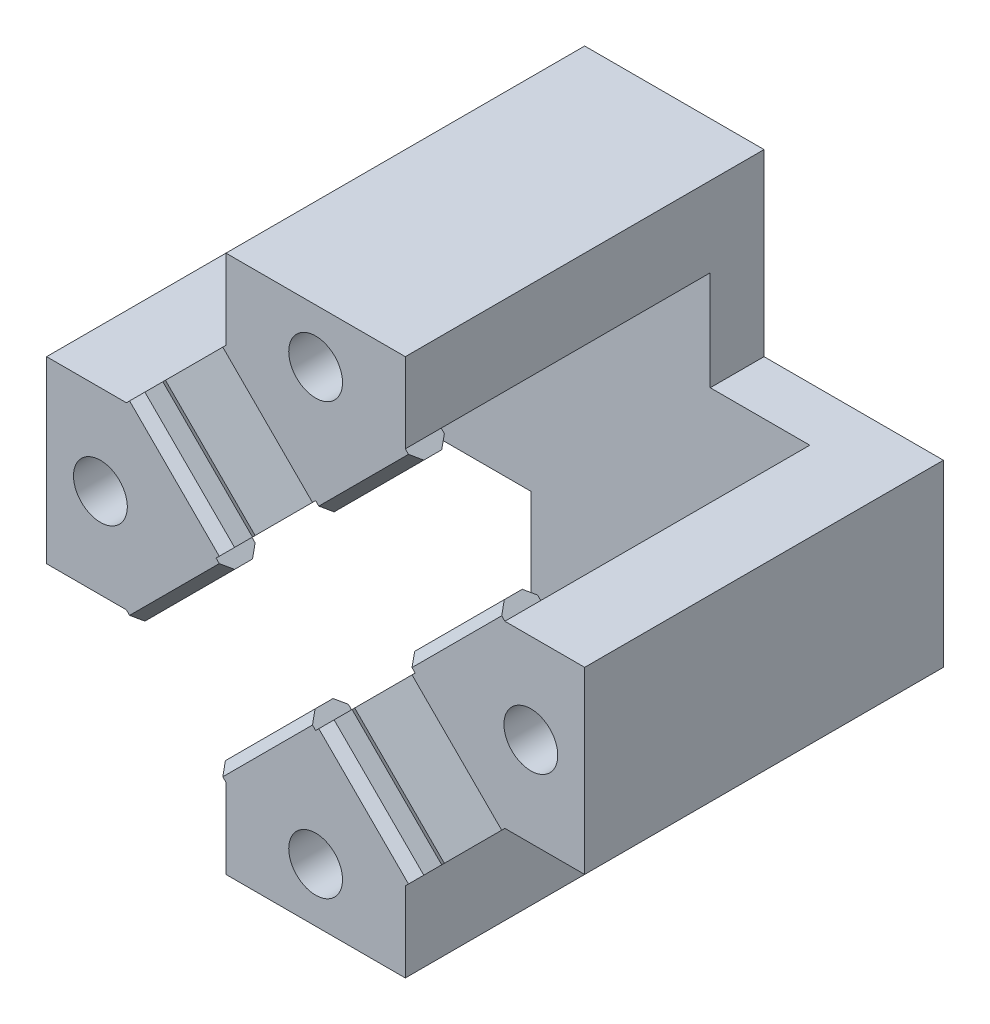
ISO-10303-21;
HEADER;
FILE_DESCRIPTION(('STEP AP214'),'2;1');
FILE_NAME('part.step','',(''),(''),'','','');
FILE_SCHEMA(('AUTOMOTIVE_DESIGN { 1 0 10303 214 1 1 1 1 }'));
ENDSEC;
DATA;
#1=APPLICATION_CONTEXT('core data for automotive mechanical design processes');
#2=APPLICATION_PROTOCOL_DEFINITION('international standard','automotive_design',2000,#1);
#3=PRODUCT_CONTEXT('',#1,'mechanical');
#4=PRODUCT('Part','Part','',(#3));
#5=PRODUCT_RELATED_PRODUCT_CATEGORY('part','',(#4));
#6=PRODUCT_DEFINITION_FORMATION('','',#4);
#7=PRODUCT_DEFINITION_CONTEXT('part definition',#1,'design');
#8=PRODUCT_DEFINITION('design','',#6,#7);
#9=PRODUCT_DEFINITION_SHAPE('','',#8);
#10=(LENGTH_UNIT() NAMED_UNIT(*) SI_UNIT(.MILLI.,.METRE.));
#11=(NAMED_UNIT(*) PLANE_ANGLE_UNIT() SI_UNIT($,.RADIAN.));
#12=(NAMED_UNIT(*) SI_UNIT($,.STERADIAN.) SOLID_ANGLE_UNIT());
#13=UNCERTAINTY_MEASURE_WITH_UNIT(LENGTH_MEASURE(1.E-05),#10,'distance_accuracy_value','');
#14=(GEOMETRIC_REPRESENTATION_CONTEXT(3) GLOBAL_UNCERTAINTY_ASSIGNED_CONTEXT((#13)) GLOBAL_UNIT_ASSIGNED_CONTEXT((#10,
#11,#12)) REPRESENTATION_CONTEXT('',''));
#15=CARTESIAN_POINT('',(0.,0.,0.));
#16=DIRECTION('',(0.,0.,1.));
#17=DIRECTION('',(1.,0.,0.));
#18=AXIS2_PLACEMENT_3D('',#15,#16,#17);
#19=CARTESIAN_POINT('',(-0.268997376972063,-0.396549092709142,20.));
#20=DIRECTION('',(-0.707106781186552,0.707106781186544,0.));
#21=DIRECTION('',(-0.707106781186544,-0.707106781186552,0.));
#22=AXIS2_PLACEMENT_3D('',#19,#20,#21);
#23=PLANE('',#22);
#24=DIRECTION('',(0.,0.,1.));
#25=VECTOR('',#24,1.);
#26=CARTESIAN_POINT('',(-0.799327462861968,-0.92687917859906,20.));
#27=LINE('',#26,#25);
#28=CARTESIAN_POINT('',(-0.799327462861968,-0.92687917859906,18.5));
#29=VERTEX_POINT('',#28);
#30=CARTESIAN_POINT('',(-0.799327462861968,-0.92687917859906,19.5));
#31=VERTEX_POINT('',#30);
#32=EDGE_CURVE('E572',#29,#31,#27,.T.);
#33=ORIENTED_EDGE('',*,*,#32,.F.);
#34=DIRECTION('',(-0.500000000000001,-0.500000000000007,0.707106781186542));
#35=VECTOR('',#34,1.);
#36=CARTESIAN_POINT('',(-0.799327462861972,-0.926879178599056,18.5));
#37=LINE('',#36,#35);
#38=CARTESIAN_POINT('',(-0.445774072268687,-0.57332578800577,18.));
#39=VERTEX_POINT('',#38);
#40=EDGE_CURVE('E910',#29,#39,#37,.F.);
#41=ORIENTED_EDGE('',*,*,#40,.T.);
#42=DIRECTION('',(0.707106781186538,0.707106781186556,0.));
#43=VECTOR('',#42,1.);
#44=CARTESIAN_POINT('',(-0.799327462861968,-0.92687917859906,18.));
#45=LINE('',#44,#43);
#46=CARTESIAN_POINT('',(-0.268997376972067,-0.396549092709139,18.));
#47=VERTEX_POINT('',#46);
#48=EDGE_CURVE('E446',#39,#47,#45,.T.);
#49=ORIENTED_EDGE('',*,*,#48,.T.);
#50=DIRECTION('',(0.,0.,-1.));
#51=VECTOR('',#50,1.);
#52=CARTESIAN_POINT('',(-0.268997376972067,-0.396549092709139,20.));
#53=LINE('',#52,#51);
#54=CARTESIAN_POINT('',(-0.268997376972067,-0.396549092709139,20.));
#55=VERTEX_POINT('',#54);
#56=EDGE_CURVE('E424',#55,#47,#53,.T.);
#57=ORIENTED_EDGE('',*,*,#56,.F.);
#58=DIRECTION('',(0.707106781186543,0.707106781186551,0.));
#59=VECTOR('',#58,1.);
#60=CARTESIAN_POINT('',(-0.268997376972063,-0.396549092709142,20.));
#61=LINE('',#60,#59);
#62=CARTESIAN_POINT('',(-0.445774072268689,-0.573325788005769,20.));
#63=VERTEX_POINT('',#62);
#64=EDGE_CURVE('E433',#63,#55,#61,.T.);
#65=ORIENTED_EDGE('',*,*,#64,.F.);
#66=DIRECTION('',(-0.500000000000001,-0.500000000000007,-0.707106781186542));
#67=VECTOR('',#66,1.);
#68=CARTESIAN_POINT('',(-0.799327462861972,-0.926879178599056,19.5));
#69=LINE('',#68,#67);
#70=EDGE_CURVE('E908',#63,#31,#69,.T.);
#71=ORIENTED_EDGE('',*,*,#70,.T.);
#72=EDGE_LOOP('',(#33,#41,#49,#57,#65,#71));
#73=FACE_BOUND('',#72,.T.);
#74=ADVANCED_FACE('F32',(#73),#23,.F.);
#75=DIRECTION('',(0.707106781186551,0.707106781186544,0.));
#76=VECTOR('',#75,1.);
#77=CARTESIAN_POINT('',(4.7310026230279,4.60345090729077,18.));
#78=LINE('',#77,#76);
#79=CARTESIAN_POINT('',(4.7310026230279,4.60345090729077,18.));
#80=VERTEX_POINT('',#79);
#81=EDGE_CURVE('E447',#47,#80,#78,.T.);
#82=ORIENTED_EDGE('',*,*,#81,.F.);
#83=DIRECTION('',(0.,0.,-1.));
#84=VECTOR('',#83,1.);
#85=CARTESIAN_POINT('',(-0.268997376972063,-0.396549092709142,20.));
#86=LINE('',#85,#84);
#87=CARTESIAN_POINT('',(-0.268997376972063,-0.396549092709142,3.));
#88=VERTEX_POINT('',#87);
#89=EDGE_CURVE('E707',#47,#88,#86,.T.);
#90=ORIENTED_EDGE('',*,*,#89,.T.);
#91=DIRECTION('',(0.707106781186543,0.707106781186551,0.));
#92=VECTOR('',#91,1.);
#93=CARTESIAN_POINT('',(-0.268997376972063,-0.396549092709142,3.));
#94=LINE('',#93,#92);
#95=CARTESIAN_POINT('',(4.73100262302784,4.60345090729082,3.));
#96=VERTEX_POINT('',#95);
#97=EDGE_CURVE('E692',#88,#96,#94,.T.);
#98=ORIENTED_EDGE('',*,*,#97,.T.);
#99=DIRECTION('',(0.,0.,-1.));
#100=VECTOR('',#99,1.);
#101=CARTESIAN_POINT('',(4.73100262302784,4.60345090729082,20.));
#102=LINE('',#101,#100);
#103=EDGE_CURVE('E699',#80,#96,#102,.T.);
#104=ORIENTED_EDGE('',*,*,#103,.F.);
#105=EDGE_LOOP('',(#82,#90,#98,#104));
#106=FACE_BOUND('',#105,.T.);
#107=ADVANCED_FACE('F987',(#106),#23,.F.);
#108=CARTESIAN_POINT('',(-5.81899737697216,-5.94654909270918,20.));
#109=DIRECTION('',(-0.707106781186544,0.707106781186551,0.));
#110=DIRECTION('',(-0.707106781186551,-0.707106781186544,0.));
#111=AXIS2_PLACEMENT_3D('',#108,#109,#110);
#112=PLANE('',#111);
#113=DIRECTION('',(0.707106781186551,0.707106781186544,0.));
#114=VECTOR('',#113,1.);
#115=CARTESIAN_POINT('',(-10.8189973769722,-10.9465490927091,18.));
#116=LINE('',#115,#114);
#117=CARTESIAN_POINT('',(-10.8189973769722,-10.9465490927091,18.));
#118=VERTEX_POINT('',#117);
#119=CARTESIAN_POINT('',(-5.81899737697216,-5.94654909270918,18.));
#120=VERTEX_POINT('',#119);
#121=EDGE_CURVE('E429',#118,#120,#116,.T.);
#122=ORIENTED_EDGE('',*,*,#121,.F.);
#123=DIRECTION('',(0.,0.,-1.));
#124=VECTOR('',#123,1.);
#125=CARTESIAN_POINT('',(-10.8189973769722,-10.9465490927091,20.));
#126=LINE('',#125,#124);
#127=CARTESIAN_POINT('',(-10.8189973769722,-10.9465490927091,3.));
#128=VERTEX_POINT('',#127);
#129=EDGE_CURVE('E658',#118,#128,#126,.T.);
#130=ORIENTED_EDGE('',*,*,#129,.T.);
#131=DIRECTION('',(0.707106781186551,0.707106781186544,0.));
#132=VECTOR('',#131,1.);
#133=CARTESIAN_POINT('',(-5.81899737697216,-5.94654909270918,3.));
#134=LINE('',#133,#132);
#135=CARTESIAN_POINT('',(-5.81899737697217,-5.94654909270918,3.));
#136=VERTEX_POINT('',#135);
#137=EDGE_CURVE('E634',#128,#136,#134,.T.);
#138=ORIENTED_EDGE('',*,*,#137,.T.);
#139=DIRECTION('',(0.,0.,-1.));
#140=VECTOR('',#139,1.);
#141=CARTESIAN_POINT('',(-5.81899737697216,-5.94654909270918,20.));
#142=LINE('',#141,#140);
#143=EDGE_CURVE('E656',#120,#136,#142,.T.);
#144=ORIENTED_EDGE('',*,*,#143,.F.);
#145=EDGE_LOOP('',(#122,#130,#138,#144));
#146=FACE_BOUND('',#145,.T.);
#147=ADVANCED_FACE('F992',(#146),#112,.F.);
#148=DIRECTION('',(-0.707106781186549,-0.707106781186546,0.));
#149=VECTOR('',#148,1.);
#150=CARTESIAN_POINT('',(-5.28866729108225,-5.41621900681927,18.));
#151=LINE('',#150,#149);
#152=CARTESIAN_POINT('',(-5.64222068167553,-5.76977239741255,18.));
#153=VERTEX_POINT('',#152);
#154=EDGE_CURVE('E550',#153,#120,#151,.T.);
#155=ORIENTED_EDGE('',*,*,#154,.F.);
#156=DIRECTION('',(-0.500000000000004,-0.499999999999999,-0.707106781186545));
#157=VECTOR('',#156,1.);
#158=CARTESIAN_POINT('',(-5.28866729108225,-5.41621900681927,18.5));
#159=LINE('',#158,#157);
#160=CARTESIAN_POINT('',(-5.28866729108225,-5.41621900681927,18.5));
#161=VERTEX_POINT('',#160);
#162=EDGE_CURVE('E900',#153,#161,#159,.F.);
#163=ORIENTED_EDGE('',*,*,#162,.T.);
#164=DIRECTION('',(0.,0.,-1.));
#165=VECTOR('',#164,1.);
#166=CARTESIAN_POINT('',(-5.28866729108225,-5.41621900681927,20.));
#167=LINE('',#166,#165);
#168=CARTESIAN_POINT('',(-5.28866729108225,-5.41621900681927,19.5));
#169=VERTEX_POINT('',#168);
#170=EDGE_CURVE('E538',#169,#161,#167,.T.);
#171=ORIENTED_EDGE('',*,*,#170,.F.);
#172=DIRECTION('',(-0.500000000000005,-0.5,0.707106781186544));
#173=VECTOR('',#172,1.);
#174=CARTESIAN_POINT('',(-5.28866729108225,-5.41621900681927,19.5));
#175=LINE('',#174,#173);
#176=CARTESIAN_POINT('',(-5.64222068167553,-5.76977239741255,20.));
#177=VERTEX_POINT('',#176);
#178=EDGE_CURVE('E898',#169,#177,#175,.T.);
#179=ORIENTED_EDGE('',*,*,#178,.T.);
#180=DIRECTION('',(0.707106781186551,0.707106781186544,0.));
#181=VECTOR('',#180,1.);
#182=CARTESIAN_POINT('',(-5.81899737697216,-5.94654909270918,20.));
#183=LINE('',#182,#181);
#184=CARTESIAN_POINT('',(-5.81899737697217,-5.94654909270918,20.));
#185=VERTEX_POINT('',#184);
#186=EDGE_CURVE('E642',#185,#177,#183,.T.);
#187=ORIENTED_EDGE('',*,*,#186,.F.);
#188=DIRECTION('',(0.,0.,1.));
#189=VECTOR('',#188,1.);
#190=CARTESIAN_POINT('',(-5.81899737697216,-5.94654909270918,20.));
#191=LINE('',#190,#189);
#192=EDGE_CURVE('E465',#120,#185,#191,.T.);
#193=ORIENTED_EDGE('',*,*,#192,.F.);
#194=EDGE_LOOP('',(#155,#163,#171,#179,#187,#193));
#195=FACE_BOUND('',#194,.T.);
#196=ADVANCED_FACE('F1157',(#195),#112,.F.);
#197=CARTESIAN_POINT('',(10.2810026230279,-0.946549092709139,20.));
#198=DIRECTION('',(0.707106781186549,-0.707106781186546,0.));
#199=DIRECTION('',(0.707106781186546,0.707106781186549,0.));
#200=AXIS2_PLACEMENT_3D('',#197,#198,#199);
#201=PLANE('',#200);
#202=DIRECTION('',(-0.707106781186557,-0.707106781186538,0.));
#203=VECTOR('',#202,1.);
#204=CARTESIAN_POINT('',(10.281002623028,-0.946549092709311,18.));
#205=LINE('',#204,#203);
#206=CARTESIAN_POINT('',(10.281002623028,-0.946549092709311,18.));
#207=VERTEX_POINT('',#206);
#208=CARTESIAN_POINT('',(5.28100262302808,-5.94654909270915,18.));
#209=VERTEX_POINT('',#208);
#210=EDGE_CURVE('E481',#207,#209,#205,.T.);
#211=ORIENTED_EDGE('',*,*,#210,.F.);
#212=DIRECTION('',(0.,0.,-1.));
#213=VECTOR('',#212,1.);
#214=CARTESIAN_POINT('',(10.2810026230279,-0.946549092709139,20.));
#215=LINE('',#214,#213);
#216=CARTESIAN_POINT('',(10.2810026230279,-0.946549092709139,3.));
#217=VERTEX_POINT('',#216);
#218=EDGE_CURVE('E620',#207,#217,#215,.T.);
#219=ORIENTED_EDGE('',*,*,#218,.T.);
#220=DIRECTION('',(-0.707106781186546,-0.707106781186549,0.));
#221=VECTOR('',#220,1.);
#222=CARTESIAN_POINT('',(10.2810026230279,-0.946549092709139,3.));
#223=LINE('',#222,#221);
#224=CARTESIAN_POINT('',(5.28100262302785,-5.94654909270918,3.));
#225=VERTEX_POINT('',#224);
#226=EDGE_CURVE('E606',#217,#225,#223,.T.);
#227=ORIENTED_EDGE('',*,*,#226,.T.);
#228=DIRECTION('',(0.,0.,-1.));
#229=VECTOR('',#228,1.);
#230=CARTESIAN_POINT('',(5.28100262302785,-5.94654909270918,20.));
#231=LINE('',#230,#229);
#232=EDGE_CURVE('E632',#209,#225,#231,.T.);
#233=ORIENTED_EDGE('',*,*,#232,.F.);
#234=EDGE_LOOP('',(#211,#219,#227,#233));
#235=FACE_BOUND('',#234,.T.);
#236=ADVANCED_FACE('F1159',(#235),#201,.F.);
#237=DIRECTION('',(0.707106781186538,0.707106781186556,0.));
#238=VECTOR('',#237,1.);
#239=CARTESIAN_POINT('',(4.75067253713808,-6.47687917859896,18.));
#240=LINE('',#239,#238);
#241=CARTESIAN_POINT('',(5.10422592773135,-6.12332578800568,18.));
#242=VERTEX_POINT('',#241);
#243=EDGE_CURVE('E565',#242,#209,#240,.T.);
#244=ORIENTED_EDGE('',*,*,#243,.F.);
#245=DIRECTION('',(-0.5,-0.500000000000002,0.707106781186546));
#246=VECTOR('',#245,1.);
#247=CARTESIAN_POINT('',(4.75067253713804,-6.47687917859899,18.5));
#248=LINE('',#247,#246);
#249=CARTESIAN_POINT('',(4.75067253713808,-6.47687917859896,18.5));
#250=VERTEX_POINT('',#249);
#251=EDGE_CURVE('E808',#242,#250,#248,.T.);
#252=ORIENTED_EDGE('',*,*,#251,.T.);
#253=DIRECTION('',(0.,0.,-1.));
#254=VECTOR('',#253,1.);
#255=CARTESIAN_POINT('',(4.75067253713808,-6.47687917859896,20.));
#256=LINE('',#255,#254);
#257=CARTESIAN_POINT('',(4.75067253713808,-6.47687917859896,19.5));
#258=VERTEX_POINT('',#257);
#259=EDGE_CURVE('E553',#258,#250,#256,.T.);
#260=ORIENTED_EDGE('',*,*,#259,.F.);
#261=DIRECTION('',(-0.5,-0.500000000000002,-0.707106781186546));
#262=VECTOR('',#261,1.);
#263=CARTESIAN_POINT('',(4.75067253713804,-6.47687917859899,19.5));
#264=LINE('',#263,#262);
#265=CARTESIAN_POINT('',(5.10422592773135,-6.12332578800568,20.));
#266=VERTEX_POINT('',#265);
#267=EDGE_CURVE('E806',#258,#266,#264,.F.);
#268=ORIENTED_EDGE('',*,*,#267,.T.);
#269=DIRECTION('',(-0.707106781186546,-0.707106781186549,0.));
#270=VECTOR('',#269,1.);
#271=CARTESIAN_POINT('',(10.2810026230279,-0.946549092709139,20.));
#272=LINE('',#271,#270);
#273=CARTESIAN_POINT('',(5.28100262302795,-5.94654909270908,20.));
#274=VERTEX_POINT('',#273);
#275=EDGE_CURVE('E607',#274,#266,#272,.T.);
#276=ORIENTED_EDGE('',*,*,#275,.F.);
#277=DIRECTION('',(0.,0.,1.));
#278=VECTOR('',#277,1.);
#279=CARTESIAN_POINT('',(5.28100262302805,-5.94654909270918,20.));
#280=LINE('',#279,#278);
#281=EDGE_CURVE('E486',#209,#274,#280,.T.);
#282=ORIENTED_EDGE('',*,*,#281,.F.);
#283=EDGE_LOOP('',(#244,#252,#260,#268,#276,#282));
#284=FACE_BOUND('',#283,.T.);
#285=ADVANCED_FACE('F1165',(#284),#201,.F.);
#286=CARTESIAN_POINT('',(-5.26899737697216,-16.4965490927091,20.));
#287=DIRECTION('',(0.707106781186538,-0.707106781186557,0.));
#288=DIRECTION('',(0.707106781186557,0.707106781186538,0.));
#289=AXIS2_PLACEMENT_3D('',#286,#287,#288);
#290=PLANE('',#289);
#291=DIRECTION('',(-0.707106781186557,-0.707106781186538,0.));
#292=VECTOR('',#291,1.);
#293=CARTESIAN_POINT('',(-5.26899737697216,-16.4965490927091,20.));
#294=LINE('',#293,#292);
#295=CARTESIAN_POINT('',(-0.0922206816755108,-11.3197723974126,20.));
#296=VERTEX_POINT('',#295);
#297=CARTESIAN_POINT('',(-0.268997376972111,-11.4965490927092,20.));
#298=VERTEX_POINT('',#297);
#299=EDGE_CURVE('E670',#296,#298,#294,.T.);
#300=ORIENTED_EDGE('',*,*,#299,.F.);
#301=DIRECTION('',(-0.500000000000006,-0.499999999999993,0.707106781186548));
#302=VECTOR('',#301,1.);
#303=CARTESIAN_POINT('',(0.261332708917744,-10.9662190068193,19.5));
#304=LINE('',#303,#302);
#305=CARTESIAN_POINT('',(0.261332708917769,-10.9662190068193,19.5));
#306=VERTEX_POINT('',#305);
#307=EDGE_CURVE('E830',#296,#306,#304,.F.);
#308=ORIENTED_EDGE('',*,*,#307,.T.);
#309=DIRECTION('',(0.,0.,1.));
#310=VECTOR('',#309,1.);
#311=CARTESIAN_POINT('',(0.261332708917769,-10.9662190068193,20.));
#312=LINE('',#311,#310);
#313=CARTESIAN_POINT('',(0.261332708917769,-10.9662190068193,18.5));
#314=VERTEX_POINT('',#313);
#315=EDGE_CURVE('E525',#314,#306,#312,.T.);
#316=ORIENTED_EDGE('',*,*,#315,.F.);
#317=DIRECTION('',(-0.500000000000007,-0.499999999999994,-0.707106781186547));
#318=VECTOR('',#317,1.);
#319=CARTESIAN_POINT('',(0.261332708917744,-10.9662190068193,18.5));
#320=LINE('',#319,#318);
#321=CARTESIAN_POINT('',(-0.0922206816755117,-11.3197723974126,18.));
#322=VERTEX_POINT('',#321);
#323=EDGE_CURVE('E828',#314,#322,#320,.T.);
#324=ORIENTED_EDGE('',*,*,#323,.T.);
#325=DIRECTION('',(-0.707106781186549,-0.707106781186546,0.));
#326=VECTOR('',#325,1.);
#327=CARTESIAN_POINT('',(0.261332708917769,-10.9662190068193,18.));
#328=LINE('',#327,#326);
#329=CARTESIAN_POINT('',(-0.26899737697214,-11.4965490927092,18.));
#330=VERTEX_POINT('',#329);
#331=EDGE_CURVE('E528',#322,#330,#328,.T.);
#332=ORIENTED_EDGE('',*,*,#331,.T.);
#333=DIRECTION('',(0.,0.,-1.));
#334=VECTOR('',#333,1.);
#335=CARTESIAN_POINT('',(-0.268997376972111,-11.4965490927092,20.));
#336=LINE('',#335,#334);
#337=EDGE_CURVE('E501',#298,#330,#336,.T.);
#338=ORIENTED_EDGE('',*,*,#337,.F.);
#339=EDGE_LOOP('',(#300,#308,#316,#324,#332,#338));
#340=FACE_BOUND('',#339,.T.);
#341=ADVANCED_FACE('F1175',(#340),#290,.F.);
#342=DIRECTION('',(-0.707106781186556,-0.707106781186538,0.));
#343=VECTOR('',#342,1.);
#344=CARTESIAN_POINT('',(-5.26899737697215,-16.4965490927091,18.));
#345=LINE('',#344,#343);
#346=CARTESIAN_POINT('',(-5.26899737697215,-16.4965490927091,18.));
#347=VERTEX_POINT('',#346);
#348=EDGE_CURVE('E506',#330,#347,#345,.T.);
#349=ORIENTED_EDGE('',*,*,#348,.F.);
#350=DIRECTION('',(0.,0.,-1.));
#351=VECTOR('',#350,1.);
#352=CARTESIAN_POINT('',(-0.268997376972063,-11.4965490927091,20.));
#353=LINE('',#352,#351);
#354=CARTESIAN_POINT('',(-0.268997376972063,-11.4965490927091,3.));
#355=VERTEX_POINT('',#354);
#356=EDGE_CURVE('E684',#330,#355,#353,.T.);
#357=ORIENTED_EDGE('',*,*,#356,.T.);
#358=DIRECTION('',(-0.707106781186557,-0.707106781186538,0.));
#359=VECTOR('',#358,1.);
#360=CARTESIAN_POINT('',(-5.26899737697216,-16.4965490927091,3.));
#361=LINE('',#360,#359);
#362=CARTESIAN_POINT('',(-5.26899737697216,-16.4965490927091,3.));
#363=VERTEX_POINT('',#362);
#364=EDGE_CURVE('E667',#355,#363,#361,.T.);
#365=ORIENTED_EDGE('',*,*,#364,.T.);
#366=DIRECTION('',(0.,0.,-1.));
#367=VECTOR('',#366,1.);
#368=CARTESIAN_POINT('',(-5.26899737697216,-16.4965490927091,20.));
#369=LINE('',#368,#367);
#370=EDGE_CURVE('E676',#347,#363,#369,.T.);
#371=ORIENTED_EDGE('',*,*,#370,.F.);
#372=EDGE_LOOP('',(#349,#357,#365,#371));
#373=FACE_BOUND('',#372,.T.);
#374=ADVANCED_FACE('F1177',(#373),#290,.F.);
#375=CARTESIAN_POINT('',(-0.268997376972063,-11.4965490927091,20.));
#376=DIRECTION('',(-0.707106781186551,-0.707106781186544,0.));
#377=DIRECTION('',(0.707106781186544,-0.707106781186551,0.));
#378=AXIS2_PLACEMENT_3D('',#375,#376,#377);
#379=PLANE('',#378);
#380=DIRECTION('',(-0.707106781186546,0.707106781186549,0.));
#381=VECTOR('',#380,1.);
#382=CARTESIAN_POINT('',(-0.268997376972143,-11.4965490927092,18.));
#383=LINE('',#382,#381);
#384=CARTESIAN_POINT('',(4.73100262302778,-16.4965490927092,18.));
#385=VERTEX_POINT('',#384);
#386=EDGE_CURVE('E521',#385,#330,#383,.T.);
#387=ORIENTED_EDGE('',*,*,#386,.F.);
#388=DIRECTION('',(0.,0.,-1.));
#389=VECTOR('',#388,1.);
#390=CARTESIAN_POINT('',(4.73100262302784,-16.4965490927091,20.));
#391=LINE('',#390,#389);
#392=CARTESIAN_POINT('',(4.73100262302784,-16.4965490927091,3.));
#393=VERTEX_POINT('',#392);
#394=EDGE_CURVE('E686',#385,#393,#391,.T.);
#395=ORIENTED_EDGE('',*,*,#394,.T.);
#396=DIRECTION('',(-0.707106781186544,0.707106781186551,0.));
#397=VECTOR('',#396,1.);
#398=CARTESIAN_POINT('',(-0.268997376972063,-11.4965490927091,3.));
#399=LINE('',#398,#397);
#400=EDGE_CURVE('E662',#393,#355,#399,.T.);
#401=ORIENTED_EDGE('',*,*,#400,.T.);
#402=ORIENTED_EDGE('',*,*,#356,.F.);
#403=EDGE_LOOP('',(#387,#395,#401,#402));
#404=FACE_BOUND('',#403,.T.);
#405=ADVANCED_FACE('F1179',(#404),#379,.F.);
#406=CARTESIAN_POINT('',(-10.8189973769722,-0.946549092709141,20.));
#407=DIRECTION('',(-0.707106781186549,-0.707106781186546,0.));
#408=DIRECTION('',(0.707106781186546,-0.707106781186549,0.));
#409=AXIS2_PLACEMENT_3D('',#406,#407,#408);
#410=PLANE('',#409);
#411=DIRECTION('',(-0.707106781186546,0.707106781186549,0.));
#412=VECTOR('',#411,1.);
#413=CARTESIAN_POINT('',(-5.81899737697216,-5.94654909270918,18.));
#414=LINE('',#413,#412);
#415=CARTESIAN_POINT('',(-10.8189973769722,-0.946549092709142,18.));
#416=VERTEX_POINT('',#415);
#417=EDGE_CURVE('E537',#120,#416,#414,.T.);
#418=ORIENTED_EDGE('',*,*,#417,.F.);
#419=ORIENTED_EDGE('',*,*,#143,.T.);
#420=DIRECTION('',(-0.707106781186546,0.707106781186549,0.));
#421=VECTOR('',#420,1.);
#422=CARTESIAN_POINT('',(-10.8189973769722,-0.946549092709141,3.));
#423=LINE('',#422,#421);
#424=CARTESIAN_POINT('',(-10.8189973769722,-0.946549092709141,3.));
#425=VERTEX_POINT('',#424);
#426=EDGE_CURVE('E639',#136,#425,#423,.T.);
#427=ORIENTED_EDGE('',*,*,#426,.T.);
#428=DIRECTION('',(0.,0.,-1.));
#429=VECTOR('',#428,1.);
#430=CARTESIAN_POINT('',(-10.8189973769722,-0.946549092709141,20.));
#431=LINE('',#430,#429);
#432=EDGE_CURVE('E648',#416,#425,#431,.T.);
#433=ORIENTED_EDGE('',*,*,#432,.F.);
#434=EDGE_LOOP('',(#418,#419,#427,#433));
#435=FACE_BOUND('',#434,.T.);
#436=ADVANCED_FACE('F1120',(#435),#410,.F.);
#437=CARTESIAN_POINT('',(5.28100262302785,-5.94654909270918,20.));
#438=DIRECTION('',(0.707106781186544,0.707106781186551,0.));
#439=DIRECTION('',(-0.707106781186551,0.707106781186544,0.));
#440=AXIS2_PLACEMENT_3D('',#437,#438,#439);
#441=PLANE('',#440);
#442=DIRECTION('',(0.707106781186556,-0.707106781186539,0.));
#443=VECTOR('',#442,1.);
#444=CARTESIAN_POINT('',(10.281002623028,-10.946549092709,18.));
#445=LINE('',#444,#443);
#446=CARTESIAN_POINT('',(10.281002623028,-10.946549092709,18.));
#447=VERTEX_POINT('',#446);
#448=EDGE_CURVE('E552',#209,#447,#445,.T.);
#449=ORIENTED_EDGE('',*,*,#448,.F.);
#450=ORIENTED_EDGE('',*,*,#232,.T.);
#451=DIRECTION('',(0.707106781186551,-0.707106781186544,0.));
#452=VECTOR('',#451,1.);
#453=CARTESIAN_POINT('',(5.28100262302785,-5.94654909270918,3.));
#454=LINE('',#453,#452);
#455=CARTESIAN_POINT('',(10.2810026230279,-10.9465490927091,3.));
#456=VERTEX_POINT('',#455);
#457=EDGE_CURVE('E611',#225,#456,#454,.T.);
#458=ORIENTED_EDGE('',*,*,#457,.T.);
#459=DIRECTION('',(0.,0.,-1.));
#460=VECTOR('',#459,1.);
#461=CARTESIAN_POINT('',(10.2810026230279,-10.9465490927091,20.));
#462=LINE('',#461,#460);
#463=EDGE_CURVE('E628',#447,#456,#462,.T.);
#464=ORIENTED_EDGE('',*,*,#463,.F.);
#465=EDGE_LOOP('',(#449,#450,#458,#464));
#466=FACE_BOUND('',#465,.T.);
#467=ADVANCED_FACE('F1000',(#466),#441,.F.);
#468=CARTESIAN_POINT('',(-5.26899737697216,4.60345090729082,20.));
#469=DIRECTION('',(0.707106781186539,0.707106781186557,0.));
#470=DIRECTION('',(-0.707106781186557,0.707106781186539,0.));
#471=AXIS2_PLACEMENT_3D('',#468,#469,#470);
#472=PLANE('',#471);
#473=DIRECTION('',(0.707106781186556,-0.707106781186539,0.));
#474=VECTOR('',#473,1.);
#475=CARTESIAN_POINT('',(-5.26899737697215,4.60345090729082,18.));
#476=LINE('',#475,#474);
#477=CARTESIAN_POINT('',(-5.26899737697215,4.60345090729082,18.));
#478=VERTEX_POINT('',#477);
#479=EDGE_CURVE('E568',#478,#47,#476,.T.);
#480=ORIENTED_EDGE('',*,*,#479,.F.);
#481=DIRECTION('',(0.,0.,-1.));
#482=VECTOR('',#481,1.);
#483=CARTESIAN_POINT('',(-5.26899737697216,4.60345090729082,20.));
#484=LINE('',#483,#482);
#485=CARTESIAN_POINT('',(-5.26899737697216,4.60345090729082,3.));
#486=VERTEX_POINT('',#485);
#487=EDGE_CURVE('E709',#478,#486,#484,.T.);
#488=ORIENTED_EDGE('',*,*,#487,.T.);
#489=DIRECTION('',(0.707106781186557,-0.707106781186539,0.));
#490=VECTOR('',#489,1.);
#491=CARTESIAN_POINT('',(-5.26899737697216,4.60345090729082,3.));
#492=LINE('',#491,#490);
#493=EDGE_CURVE('E690',#486,#88,#492,.T.);
#494=ORIENTED_EDGE('',*,*,#493,.T.);
#495=ORIENTED_EDGE('',*,*,#89,.F.);
#496=EDGE_LOOP('',(#480,#488,#494,#495));
#497=FACE_BOUND('',#496,.T.);
#498=ADVANCED_FACE('F964',(#497),#472,.F.);
#499=CARTESIAN_POINT('',(0.,0.,3.));
#500=DIRECTION('',(0.,0.,1.));
#501=DIRECTION('',(1.,0.,0.));
#502=AXIS2_PLACEMENT_3D('',#499,#500,#501);
#503=PLANE('',#502);
#504=ORIENTED_EDGE('',*,*,#457,.F.);
#505=ORIENTED_EDGE('',*,*,#226,.F.);
#506=DIRECTION('',(1.,0.,0.));
#507=VECTOR('',#506,1.);
#508=CARTESIAN_POINT('',(0.,-0.946549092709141,3.));
#509=LINE('',#508,#507);
#510=CARTESIAN_POINT('',(4.73100262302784,-0.946549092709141,3.));
#511=VERTEX_POINT('',#510);
#512=EDGE_CURVE('E731',#511,#217,#509,.T.);
#513=ORIENTED_EDGE('',*,*,#512,.F.);
#514=DIRECTION('',(0.,-1.,0.));
#515=VECTOR('',#514,1.);
#516=CARTESIAN_POINT('',(4.73100262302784,0.,3.));
#517=LINE('',#516,#515);
#518=EDGE_CURVE('E734',#96,#511,#517,.T.);
#519=ORIENTED_EDGE('',*,*,#518,.F.);
#520=ORIENTED_EDGE('',*,*,#97,.F.);
#521=ORIENTED_EDGE('',*,*,#493,.F.);
#522=DIRECTION('',(0.,-1.,0.));
#523=VECTOR('',#522,1.);
#524=CARTESIAN_POINT('',(-5.26899737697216,0.,3.));
#525=LINE('',#524,#523);
#526=CARTESIAN_POINT('',(-5.26899737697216,-0.946549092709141,3.));
#527=VERTEX_POINT('',#526);
#528=EDGE_CURVE('E714',#486,#527,#525,.T.);
#529=ORIENTED_EDGE('',*,*,#528,.T.);
#530=DIRECTION('',(1.,0.,0.));
#531=VECTOR('',#530,1.);
#532=CARTESIAN_POINT('',(0.,-0.946549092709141,3.));
#533=LINE('',#532,#531);
#534=EDGE_CURVE('E717',#425,#527,#533,.T.);
#535=ORIENTED_EDGE('',*,*,#534,.F.);
#536=ORIENTED_EDGE('',*,*,#426,.F.);
#537=ORIENTED_EDGE('',*,*,#137,.F.);
#538=DIRECTION('',(1.,0.,0.));
#539=VECTOR('',#538,1.);
#540=CARTESIAN_POINT('',(0.,-10.9465490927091,3.));
#541=LINE('',#540,#539);
#542=CARTESIAN_POINT('',(-5.26899737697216,-10.9465490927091,3.));
#543=VERTEX_POINT('',#542);
#544=EDGE_CURVE('E720',#128,#543,#541,.T.);
#545=ORIENTED_EDGE('',*,*,#544,.T.);
#546=DIRECTION('',(0.,-1.,0.));
#547=VECTOR('',#546,1.);
#548=CARTESIAN_POINT('',(-5.26899737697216,0.,3.));
#549=LINE('',#548,#547);
#550=EDGE_CURVE('E722',#543,#363,#549,.T.);
#551=ORIENTED_EDGE('',*,*,#550,.T.);
#552=ORIENTED_EDGE('',*,*,#364,.F.);
#553=ORIENTED_EDGE('',*,*,#400,.F.);
#554=DIRECTION('',(0.,-1.,0.));
#555=VECTOR('',#554,1.);
#556=CARTESIAN_POINT('',(4.73100262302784,0.,3.));
#557=LINE('',#556,#555);
#558=CARTESIAN_POINT('',(4.73100262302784,-10.9465490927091,3.));
#559=VERTEX_POINT('',#558);
#560=EDGE_CURVE('E725',#559,#393,#557,.T.);
#561=ORIENTED_EDGE('',*,*,#560,.F.);
#562=DIRECTION('',(1.,0.,0.));
#563=VECTOR('',#562,1.);
#564=CARTESIAN_POINT('',(0.,-10.9465490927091,3.));
#565=LINE('',#564,#563);
#566=EDGE_CURVE('E728',#559,#456,#565,.T.);
#567=ORIENTED_EDGE('',*,*,#566,.T.);
#568=EDGE_LOOP('',(#504,#505,#513,#519,#520,#521,#529,#535,#536,#537,#545,#551,#552,#553,#561,#567));
#569=FACE_BOUND('',#568,.T.);
#570=ADVANCED_FACE('F999',(#569),#503,.T.);
#571=CARTESIAN_POINT('',(-5.26899737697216,0.,3.));
#572=DIRECTION('',(1.,0.,0.));
#573=DIRECTION('',(0.,0.,-1.));
#574=AXIS2_PLACEMENT_3D('',#571,#572,#573);
#575=PLANE('',#574);
#576=DIRECTION('',(0.,-1.,0.));
#577=VECTOR('',#576,1.);
#578=CARTESIAN_POINT('',(-5.26899737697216,0.,0.));
#579=LINE('',#578,#577);
#580=CARTESIAN_POINT('',(-5.26899737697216,9.05345090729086,0.));
#581=VERTEX_POINT('',#580);
#582=CARTESIAN_POINT('',(-5.26899737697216,-0.946549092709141,0.));
#583=VERTEX_POINT('',#582);
#584=EDGE_CURVE('E713',#581,#583,#579,.T.);
#585=ORIENTED_EDGE('',*,*,#584,.T.);
#586=DIRECTION('',(0.,0.,-1.));
#587=VECTOR('',#586,1.);
#588=CARTESIAN_POINT('',(-5.26899737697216,-0.946549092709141,3.));
#589=LINE('',#588,#587);
#590=EDGE_CURVE('E792',#527,#583,#589,.T.);
#591=ORIENTED_EDGE('',*,*,#590,.F.);
#592=ORIENTED_EDGE('',*,*,#528,.F.);
#593=ORIENTED_EDGE('',*,*,#487,.F.);
#594=CARTESIAN_POINT('',(-5.26899737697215,4.60345090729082,20.));
#595=VERTEX_POINT('',#594);
#596=EDGE_CURVE('E710',#595,#478,#484,.T.);
#597=ORIENTED_EDGE('',*,*,#596,.F.);
#598=DIRECTION('',(0.,-1.,0.));
#599=VECTOR('',#598,1.);
#600=CARTESIAN_POINT('',(-5.26899737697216,9.05345090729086,20.));
#601=LINE('',#600,#599);
#602=CARTESIAN_POINT('',(-5.26899737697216,9.05345090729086,20.));
#603=VERTEX_POINT('',#602);
#604=EDGE_CURVE('E441',#603,#595,#601,.T.);
#605=ORIENTED_EDGE('',*,*,#604,.F.);
#606=DIRECTION('',(0.,0.,-1.));
#607=VECTOR('',#606,1.);
#608=CARTESIAN_POINT('',(-5.26899737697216,9.05345090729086,3.));
#609=LINE('',#608,#607);
#610=EDGE_CURVE('E736',#603,#581,#609,.T.);
#611=ORIENTED_EDGE('',*,*,#610,.T.);
#612=EDGE_LOOP('',(#585,#591,#592,#593,#597,#605,#611));
#613=FACE_BOUND('',#612,.T.);
#614=ADVANCED_FACE('F953',(#613),#575,.F.);
#615=CARTESIAN_POINT('',(0.,-0.946549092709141,3.));
#616=DIRECTION('',(0.,1.,0.));
#617=DIRECTION('',(0.,0.,1.));
#618=AXIS2_PLACEMENT_3D('',#615,#616,#617);
#619=PLANE('',#618);
#620=DIRECTION('',(1.,0.,0.));
#621=VECTOR('',#620,1.);
#622=CARTESIAN_POINT('',(0.,-0.946549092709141,0.));
#623=LINE('',#622,#621);
#624=CARTESIAN_POINT('',(-15.2689973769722,-0.946549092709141,0.));
#625=VERTEX_POINT('',#624);
#626=EDGE_CURVE('E739',#625,#583,#623,.T.);
#627=ORIENTED_EDGE('',*,*,#626,.F.);
#628=DIRECTION('',(0.,0.,-1.));
#629=VECTOR('',#628,1.);
#630=CARTESIAN_POINT('',(-15.2689973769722,-0.946549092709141,3.));
#631=LINE('',#630,#629);
#632=CARTESIAN_POINT('',(-15.2689973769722,-0.946549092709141,20.));
#633=VERTEX_POINT('',#632);
#634=EDGE_CURVE('E790',#633,#625,#631,.T.);
#635=ORIENTED_EDGE('',*,*,#634,.F.);
#636=DIRECTION('',(-1.,0.,0.));
#637=VECTOR('',#636,1.);
#638=CARTESIAN_POINT('',(-15.2689973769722,-0.946549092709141,20.));
#639=LINE('',#638,#637);
#640=CARTESIAN_POINT('',(-10.8189973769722,-0.946549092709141,20.));
#641=VERTEX_POINT('',#640);
#642=EDGE_CURVE('E645',#641,#633,#639,.T.);
#643=ORIENTED_EDGE('',*,*,#642,.F.);
#644=EDGE_CURVE('E653',#641,#416,#431,.T.);
#645=ORIENTED_EDGE('',*,*,#644,.T.);
#646=ORIENTED_EDGE('',*,*,#432,.T.);
#647=ORIENTED_EDGE('',*,*,#534,.T.);
#648=ORIENTED_EDGE('',*,*,#590,.T.);
#649=EDGE_LOOP('',(#627,#635,#643,#645,#646,#647,#648));
#650=FACE_BOUND('',#649,.T.);
#651=ADVANCED_FACE('F1043',(#650),#619,.T.);
#652=CARTESIAN_POINT('',(-15.2689973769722,0.,3.));
#653=DIRECTION('',(1.,0.,0.));
#654=DIRECTION('',(0.,1.,0.));
#655=AXIS2_PLACEMENT_3D('',#652,#653,#654);
#656=PLANE('',#655);
#657=DIRECTION('',(0.,-1.,0.));
#658=VECTOR('',#657,1.);
#659=CARTESIAN_POINT('',(-15.2689973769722,0.,0.));
#660=LINE('',#659,#658);
#661=CARTESIAN_POINT('',(-15.2689973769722,-10.9465490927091,0.));
#662=VERTEX_POINT('',#661);
#663=EDGE_CURVE('E742',#625,#662,#660,.T.);
#664=ORIENTED_EDGE('',*,*,#663,.T.);
#665=DIRECTION('',(0.,0.,-1.));
#666=VECTOR('',#665,1.);
#667=CARTESIAN_POINT('',(-15.2689973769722,-10.9465490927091,3.));
#668=LINE('',#667,#666);
#669=CARTESIAN_POINT('',(-15.2689973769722,-10.9465490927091,20.));
#670=VERTEX_POINT('',#669);
#671=EDGE_CURVE('E787',#670,#662,#668,.T.);
#672=ORIENTED_EDGE('',*,*,#671,.F.);
#673=DIRECTION('',(0.,-1.,0.));
#674=VECTOR('',#673,1.);
#675=CARTESIAN_POINT('',(-15.2689973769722,-0.946549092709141,20.));
#676=LINE('',#675,#674);
#677=EDGE_CURVE('E635',#633,#670,#676,.T.);
#678=ORIENTED_EDGE('',*,*,#677,.F.);
#679=ORIENTED_EDGE('',*,*,#634,.T.);
#680=EDGE_LOOP('',(#664,#672,#678,#679));
#681=FACE_BOUND('',#680,.T.);
#682=ADVANCED_FACE('F1039',(#681),#656,.F.);
#683=CARTESIAN_POINT('',(0.,-10.9465490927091,3.));
#684=DIRECTION('',(0.,1.,0.));
#685=DIRECTION('',(-1.,0.,0.));
#686=AXIS2_PLACEMENT_3D('',#683,#684,#685);
#687=PLANE('',#686);
#688=DIRECTION('',(1.,0.,0.));
#689=VECTOR('',#688,1.);
#690=CARTESIAN_POINT('',(0.,-10.9465490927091,0.));
#691=LINE('',#690,#689);
#692=CARTESIAN_POINT('',(-5.26899737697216,-10.9465490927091,0.));
#693=VERTEX_POINT('',#692);
#694=EDGE_CURVE('E744',#662,#693,#691,.T.);
#695=ORIENTED_EDGE('',*,*,#694,.T.);
#696=DIRECTION('',(0.,0.,-1.));
#697=VECTOR('',#696,1.);
#698=CARTESIAN_POINT('',(-5.26899737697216,-10.9465490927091,3.));
#699=LINE('',#698,#697);
#700=EDGE_CURVE('E784',#543,#693,#699,.T.);
#701=ORIENTED_EDGE('',*,*,#700,.F.);
#702=ORIENTED_EDGE('',*,*,#544,.F.);
#703=ORIENTED_EDGE('',*,*,#129,.F.);
#704=CARTESIAN_POINT('',(-10.8189973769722,-10.9465490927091,20.));
#705=VERTEX_POINT('',#704);
#706=EDGE_CURVE('E659',#705,#118,#126,.T.);
#707=ORIENTED_EDGE('',*,*,#706,.F.);
#708=DIRECTION('',(1.,0.,0.));
#709=VECTOR('',#708,1.);
#710=CARTESIAN_POINT('',(-15.2689973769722,-10.9465490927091,20.));
#711=LINE('',#710,#709);
#712=EDGE_CURVE('E638',#670,#705,#711,.T.);
#713=ORIENTED_EDGE('',*,*,#712,.F.);
#714=ORIENTED_EDGE('',*,*,#671,.T.);
#715=EDGE_LOOP('',(#695,#701,#702,#703,#707,#713,#714));
#716=FACE_BOUND('',#715,.T.);
#717=ADVANCED_FACE('F1035',(#716),#687,.F.);
#718=CARTESIAN_POINT('',(-5.26899737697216,0.,3.));
#719=DIRECTION('',(1.,0.,0.));
#720=DIRECTION('',(0.,0.,-1.));
#721=AXIS2_PLACEMENT_3D('',#718,#719,#720);
#722=PLANE('',#721);
#723=DIRECTION('',(0.,-1.,0.));
#724=VECTOR('',#723,1.);
#725=CARTESIAN_POINT('',(-5.26899737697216,0.,0.));
#726=LINE('',#725,#724);
#727=CARTESIAN_POINT('',(-5.26899737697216,-20.9465490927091,0.));
#728=VERTEX_POINT('',#727);
#729=EDGE_CURVE('E746',#693,#728,#726,.T.);
#730=ORIENTED_EDGE('',*,*,#729,.T.);
#731=DIRECTION('',(0.,0.,-1.));
#732=VECTOR('',#731,1.);
#733=CARTESIAN_POINT('',(-5.26899737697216,-20.9465490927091,3.));
#734=LINE('',#733,#732);
#735=CARTESIAN_POINT('',(-5.26899737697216,-20.9465490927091,20.));
#736=VERTEX_POINT('',#735);
#737=EDGE_CURVE('E781',#736,#728,#734,.T.);
#738=ORIENTED_EDGE('',*,*,#737,.F.);
#739=DIRECTION('',(0.,-1.,0.));
#740=VECTOR('',#739,1.);
#741=CARTESIAN_POINT('',(-5.26899737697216,-20.9465490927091,20.));
#742=LINE('',#741,#740);
#743=CARTESIAN_POINT('',(-5.26899737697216,-16.4965490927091,20.));
#744=VERTEX_POINT('',#743);
#745=EDGE_CURVE('E673',#744,#736,#742,.T.);
#746=ORIENTED_EDGE('',*,*,#745,.F.);
#747=EDGE_CURVE('E681',#744,#347,#369,.T.);
#748=ORIENTED_EDGE('',*,*,#747,.T.);
#749=ORIENTED_EDGE('',*,*,#370,.T.);
#750=ORIENTED_EDGE('',*,*,#550,.F.);
#751=ORIENTED_EDGE('',*,*,#700,.T.);
#752=EDGE_LOOP('',(#730,#738,#746,#748,#749,#750,#751));
#753=FACE_BOUND('',#752,.T.);
#754=ADVANCED_FACE('F1031',(#753),#722,.F.);
#755=CARTESIAN_POINT('',(0.,-20.9465490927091,3.));
#756=DIRECTION('',(0.,1.,0.));
#757=DIRECTION('',(0.,0.,1.));
#758=AXIS2_PLACEMENT_3D('',#755,#756,#757);
#759=PLANE('',#758);
#760=DIRECTION('',(1.,0.,0.));
#761=VECTOR('',#760,1.);
#762=CARTESIAN_POINT('',(0.,-20.9465490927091,0.));
#763=LINE('',#762,#761);
#764=CARTESIAN_POINT('',(4.73100262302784,-20.9465490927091,0.));
#765=VERTEX_POINT('',#764);
#766=EDGE_CURVE('E748',#728,#765,#763,.T.);
#767=ORIENTED_EDGE('',*,*,#766,.T.);
#768=DIRECTION('',(0.,0.,-1.));
#769=VECTOR('',#768,1.);
#770=CARTESIAN_POINT('',(4.73100262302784,-20.9465490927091,3.));
#771=LINE('',#770,#769);
#772=CARTESIAN_POINT('',(4.73100262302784,-20.9465490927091,20.));
#773=VERTEX_POINT('',#772);
#774=EDGE_CURVE('E779',#773,#765,#771,.T.);
#775=ORIENTED_EDGE('',*,*,#774,.F.);
#776=DIRECTION('',(1.,0.,0.));
#777=VECTOR('',#776,1.);
#778=CARTESIAN_POINT('',(-5.26899737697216,-20.9465490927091,20.));
#779=LINE('',#778,#777);
#780=EDGE_CURVE('E663',#736,#773,#779,.T.);
#781=ORIENTED_EDGE('',*,*,#780,.F.);
#782=ORIENTED_EDGE('',*,*,#737,.T.);
#783=EDGE_LOOP('',(#767,#775,#781,#782));
#784=FACE_BOUND('',#783,.T.);
#785=ADVANCED_FACE('F1027',(#784),#759,.F.);
#786=CARTESIAN_POINT('',(4.73100262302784,0.,3.));
#787=DIRECTION('',(1.,0.,0.));
#788=DIRECTION('',(0.,0.,-1.));
#789=AXIS2_PLACEMENT_3D('',#786,#787,#788);
#790=PLANE('',#789);
#791=DIRECTION('',(0.,-1.,0.));
#792=VECTOR('',#791,1.);
#793=CARTESIAN_POINT('',(4.73100262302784,0.,0.));
#794=LINE('',#793,#792);
#795=CARTESIAN_POINT('',(4.73100262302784,-10.9465490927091,0.));
#796=VERTEX_POINT('',#795);
#797=EDGE_CURVE('E751',#796,#765,#794,.T.);
#798=ORIENTED_EDGE('',*,*,#797,.F.);
#799=DIRECTION('',(0.,0.,-1.));
#800=VECTOR('',#799,1.);
#801=CARTESIAN_POINT('',(4.73100262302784,-10.9465490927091,3.));
#802=LINE('',#801,#800);
#803=EDGE_CURVE('E777',#559,#796,#802,.T.);
#804=ORIENTED_EDGE('',*,*,#803,.F.);
#805=ORIENTED_EDGE('',*,*,#560,.T.);
#806=ORIENTED_EDGE('',*,*,#394,.F.);
#807=CARTESIAN_POINT('',(4.73100262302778,-16.4965490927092,20.));
#808=VERTEX_POINT('',#807);
#809=EDGE_CURVE('E687',#808,#385,#391,.T.);
#810=ORIENTED_EDGE('',*,*,#809,.F.);
#811=DIRECTION('',(0.,1.,0.));
#812=VECTOR('',#811,1.);
#813=CARTESIAN_POINT('',(4.73100262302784,-20.9465490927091,20.));
#814=LINE('',#813,#812);
#815=EDGE_CURVE('E666',#773,#808,#814,.T.);
#816=ORIENTED_EDGE('',*,*,#815,.F.);
#817=ORIENTED_EDGE('',*,*,#774,.T.);
#818=EDGE_LOOP('',(#798,#804,#805,#806,#810,#816,#817));
#819=FACE_BOUND('',#818,.T.);
#820=ADVANCED_FACE('F1023',(#819),#790,.T.);
#821=CARTESIAN_POINT('',(0.,-10.9465490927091,3.));
#822=DIRECTION('',(0.,1.,0.));
#823=DIRECTION('',(-1.,0.,0.));
#824=AXIS2_PLACEMENT_3D('',#821,#822,#823);
#825=PLANE('',#824);
#826=DIRECTION('',(1.,0.,0.));
#827=VECTOR('',#826,1.);
#828=CARTESIAN_POINT('',(0.,-10.9465490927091,0.));
#829=LINE('',#828,#827);
#830=CARTESIAN_POINT('',(14.7310026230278,-10.9465490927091,0.));
#831=VERTEX_POINT('',#830);
#832=EDGE_CURVE('E754',#796,#831,#829,.T.);
#833=ORIENTED_EDGE('',*,*,#832,.T.);
#834=DIRECTION('',(0.,0.,-1.));
#835=VECTOR('',#834,1.);
#836=CARTESIAN_POINT('',(14.7310026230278,-10.9465490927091,3.));
#837=LINE('',#836,#835);
#838=CARTESIAN_POINT('',(14.7310026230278,-10.9465490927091,20.));
#839=VERTEX_POINT('',#838);
#840=EDGE_CURVE('E775',#839,#831,#837,.T.);
#841=ORIENTED_EDGE('',*,*,#840,.F.);
#842=DIRECTION('',(1.,0.,0.));
#843=VECTOR('',#842,1.);
#844=CARTESIAN_POINT('',(14.7310026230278,-10.9465490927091,20.));
#845=LINE('',#844,#843);
#846=CARTESIAN_POINT('',(10.2810026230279,-10.9465490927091,20.));
#847=VERTEX_POINT('',#846);
#848=EDGE_CURVE('E610',#847,#839,#845,.T.);
#849=ORIENTED_EDGE('',*,*,#848,.F.);
#850=EDGE_CURVE('E629',#847,#447,#462,.T.);
#851=ORIENTED_EDGE('',*,*,#850,.T.);
#852=ORIENTED_EDGE('',*,*,#463,.T.);
#853=ORIENTED_EDGE('',*,*,#566,.F.);
#854=ORIENTED_EDGE('',*,*,#803,.T.);
#855=EDGE_LOOP('',(#833,#841,#849,#851,#852,#853,#854));
#856=FACE_BOUND('',#855,.T.);
#857=ADVANCED_FACE('F1019',(#856),#825,.F.);
#858=CARTESIAN_POINT('',(14.7310026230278,0.,3.));
#859=DIRECTION('',(1.,0.,0.));
#860=DIRECTION('',(0.,1.,0.));
#861=AXIS2_PLACEMENT_3D('',#858,#859,#860);
#862=PLANE('',#861);
#863=DIRECTION('',(0.,-1.,0.));
#864=VECTOR('',#863,1.);
#865=CARTESIAN_POINT('',(14.7310026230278,0.,0.));
#866=LINE('',#865,#864);
#867=CARTESIAN_POINT('',(14.7310026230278,-0.946549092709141,0.));
#868=VERTEX_POINT('',#867);
#869=EDGE_CURVE('E757',#868,#831,#866,.T.);
#870=ORIENTED_EDGE('',*,*,#869,.F.);
#871=DIRECTION('',(0.,0.,-1.));
#872=VECTOR('',#871,1.);
#873=CARTESIAN_POINT('',(14.7310026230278,-0.946549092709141,3.));
#874=LINE('',#873,#872);
#875=CARTESIAN_POINT('',(14.7310026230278,-0.946549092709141,20.));
#876=VERTEX_POINT('',#875);
#877=EDGE_CURVE('E773',#876,#868,#874,.T.);
#878=ORIENTED_EDGE('',*,*,#877,.F.);
#879=DIRECTION('',(0.,1.,0.));
#880=VECTOR('',#879,1.);
#881=CARTESIAN_POINT('',(14.7310026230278,-0.946549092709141,20.));
#882=LINE('',#881,#880);
#883=EDGE_CURVE('E614',#839,#876,#882,.T.);
#884=ORIENTED_EDGE('',*,*,#883,.F.);
#885=ORIENTED_EDGE('',*,*,#840,.T.);
#886=EDGE_LOOP('',(#870,#878,#884,#885));
#887=FACE_BOUND('',#886,.T.);
#888=ADVANCED_FACE('F1015',(#887),#862,.T.);
#889=CARTESIAN_POINT('',(0.,-0.946549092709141,3.));
#890=DIRECTION('',(0.,1.,0.));
#891=DIRECTION('',(0.,0.,1.));
#892=AXIS2_PLACEMENT_3D('',#889,#890,#891);
#893=PLANE('',#892);
#894=DIRECTION('',(1.,0.,0.));
#895=VECTOR('',#894,1.);
#896=CARTESIAN_POINT('',(0.,-0.946549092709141,0.));
#897=LINE('',#896,#895);
#898=CARTESIAN_POINT('',(4.73100262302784,-0.946549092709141,0.));
#899=VERTEX_POINT('',#898);
#900=EDGE_CURVE('E760',#899,#868,#897,.T.);
#901=ORIENTED_EDGE('',*,*,#900,.F.);
#902=DIRECTION('',(0.,0.,-1.));
#903=VECTOR('',#902,1.);
#904=CARTESIAN_POINT('',(4.73100262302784,-0.946549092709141,3.));
#905=LINE('',#904,#903);
#906=EDGE_CURVE('E771',#511,#899,#905,.T.);
#907=ORIENTED_EDGE('',*,*,#906,.F.);
#908=ORIENTED_EDGE('',*,*,#512,.T.);
#909=ORIENTED_EDGE('',*,*,#218,.F.);
#910=CARTESIAN_POINT('',(10.281002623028,-0.946549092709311,20.));
#911=VERTEX_POINT('',#910);
#912=EDGE_CURVE('E625',#911,#207,#215,.T.);
#913=ORIENTED_EDGE('',*,*,#912,.F.);
#914=DIRECTION('',(-1.,0.,0.));
#915=VECTOR('',#914,1.);
#916=CARTESIAN_POINT('',(14.7310026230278,-0.946549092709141,20.));
#917=LINE('',#916,#915);
#918=EDGE_CURVE('E617',#876,#911,#917,.T.);
#919=ORIENTED_EDGE('',*,*,#918,.F.);
#920=ORIENTED_EDGE('',*,*,#877,.T.);
#921=EDGE_LOOP('',(#901,#907,#908,#909,#913,#919,#920));
#922=FACE_BOUND('',#921,.T.);
#923=ADVANCED_FACE('F1012',(#922),#893,.T.);
#924=CARTESIAN_POINT('',(4.73100262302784,0.,3.));
#925=DIRECTION('',(1.,0.,0.));
#926=DIRECTION('',(0.,0.,-1.));
#927=AXIS2_PLACEMENT_3D('',#924,#925,#926);
#928=PLANE('',#927);
#929=DIRECTION('',(0.,-1.,0.));
#930=VECTOR('',#929,1.);
#931=CARTESIAN_POINT('',(4.73100262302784,0.,0.));
#932=LINE('',#931,#930);
#933=CARTESIAN_POINT('',(4.73100262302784,9.05345090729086,0.));
#934=VERTEX_POINT('',#933);
#935=EDGE_CURVE('E763',#934,#899,#932,.T.);
#936=ORIENTED_EDGE('',*,*,#935,.F.);
#937=DIRECTION('',(0.,0.,-1.));
#938=VECTOR('',#937,1.);
#939=CARTESIAN_POINT('',(4.73100262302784,9.05345090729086,3.));
#940=LINE('',#939,#938);
#941=CARTESIAN_POINT('',(4.73100262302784,9.05345090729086,20.));
#942=VERTEX_POINT('',#941);
#943=EDGE_CURVE('E769',#942,#934,#940,.T.);
#944=ORIENTED_EDGE('',*,*,#943,.F.);
#945=DIRECTION('',(0.,1.,0.));
#946=VECTOR('',#945,1.);
#947=CARTESIAN_POINT('',(4.73100262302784,9.05345090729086,20.));
#948=LINE('',#947,#946);
#949=CARTESIAN_POINT('',(4.73100262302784,4.60345090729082,20.));
#950=VERTEX_POINT('',#949);
#951=EDGE_CURVE('E440',#950,#942,#948,.T.);
#952=ORIENTED_EDGE('',*,*,#951,.F.);
#953=EDGE_CURVE('E704',#950,#80,#102,.T.);
#954=ORIENTED_EDGE('',*,*,#953,.T.);
#955=ORIENTED_EDGE('',*,*,#103,.T.);
#956=ORIENTED_EDGE('',*,*,#518,.T.);
#957=ORIENTED_EDGE('',*,*,#906,.T.);
#958=EDGE_LOOP('',(#936,#944,#952,#954,#955,#956,#957));
#959=FACE_BOUND('',#958,.T.);
#960=ADVANCED_FACE('F946',(#959),#928,.T.);
#961=CARTESIAN_POINT('',(0.,9.05345090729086,3.));
#962=DIRECTION('',(0.,1.,0.));
#963=DIRECTION('',(0.,0.,1.));
#964=AXIS2_PLACEMENT_3D('',#961,#962,#963);
#965=PLANE('',#964);
#966=DIRECTION('',(1.,0.,0.));
#967=VECTOR('',#966,1.);
#968=CARTESIAN_POINT('',(0.,9.05345090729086,0.));
#969=LINE('',#968,#967);
#970=EDGE_CURVE('E718',#581,#934,#969,.T.);
#971=ORIENTED_EDGE('',*,*,#970,.F.);
#972=ORIENTED_EDGE('',*,*,#610,.F.);
#973=DIRECTION('',(-1.,0.,0.));
#974=VECTOR('',#973,1.);
#975=CARTESIAN_POINT('',(-5.26899737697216,9.05345090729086,20.));
#976=LINE('',#975,#974);
#977=EDGE_CURVE('E696',#942,#603,#976,.T.);
#978=ORIENTED_EDGE('',*,*,#977,.F.);
#979=ORIENTED_EDGE('',*,*,#943,.T.);
#980=EDGE_LOOP('',(#971,#972,#978,#979));
#981=FACE_BOUND('',#980,.T.);
#982=ADVANCED_FACE('F949',(#981),#965,.T.);
#983=CARTESIAN_POINT('',(0.,0.,0.));
#984=DIRECTION('',(0.,0.,1.));
#985=DIRECTION('',(1.,0.,0.));
#986=AXIS2_PLACEMENT_3D('',#983,#984,#985);
#987=PLANE('',#986);
#988=CARTESIAN_POINT('',(11.7310026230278,-5.94654909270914,0.));
#989=DIRECTION('',(0.,0.,1.));
#990=DIRECTION('',(1.,0.,0.));
#991=AXIS2_PLACEMENT_3D('',#988,#989,#990);
#992=CIRCLE('',#991,1.5);
#993=CARTESIAN_POINT('',(13.2310026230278,-5.94654909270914,0.));
#994=VERTEX_POINT('',#993);
#995=EDGE_CURVE('E586',#994,#994,#992,.T.);
#996=ORIENTED_EDGE('',*,*,#995,.T.);
#997=EDGE_LOOP('',(#996));
#998=FACE_BOUND('',#997,.T.);
#999=CARTESIAN_POINT('',(-12.2689973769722,-5.94654909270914,0.));
#1000=DIRECTION('',(0.,0.,1.));
#1001=DIRECTION('',(1.,0.,0.));
#1002=AXIS2_PLACEMENT_3D('',#999,#1000,#1001);
#1003=CIRCLE('',#1002,1.5);
#1004=CARTESIAN_POINT('',(-10.7689973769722,-5.94654909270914,0.));
#1005=VERTEX_POINT('',#1004);
#1006=EDGE_CURVE('E594',#1005,#1005,#1003,.T.);
#1007=ORIENTED_EDGE('',*,*,#1006,.T.);
#1008=EDGE_LOOP('',(#1007));
#1009=FACE_BOUND('',#1008,.T.);
#1010=CARTESIAN_POINT('',(-0.268997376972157,-17.9465490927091,0.));
#1011=DIRECTION('',(0.,0.,1.));
#1012=DIRECTION('',(1.,0.,0.));
#1013=AXIS2_PLACEMENT_3D('',#1010,#1011,#1012);
#1014=CIRCLE('',#1013,1.5);
#1015=CARTESIAN_POINT('',(1.23100262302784,-17.9465490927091,0.));
#1016=VERTEX_POINT('',#1015);
#1017=EDGE_CURVE('E597',#1016,#1016,#1014,.T.);
#1018=ORIENTED_EDGE('',*,*,#1017,.T.);
#1019=EDGE_LOOP('',(#1018));
#1020=FACE_BOUND('',#1019,.T.);
#1021=CARTESIAN_POINT('',(-0.268997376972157,6.05345090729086,0.));
#1022=DIRECTION('',(0.,0.,1.));
#1023=DIRECTION('',(1.,0.,0.));
#1024=AXIS2_PLACEMENT_3D('',#1021,#1022,#1023);
#1025=CIRCLE('',#1024,1.5);
#1026=CARTESIAN_POINT('',(1.23100262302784,6.05345090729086,0.));
#1027=VERTEX_POINT('',#1026);
#1028=EDGE_CURVE('E603',#1027,#1027,#1025,.T.);
#1029=ORIENTED_EDGE('',*,*,#1028,.T.);
#1030=EDGE_LOOP('',(#1029));
#1031=FACE_BOUND('',#1030,.T.);
#1032=ORIENTED_EDGE('',*,*,#584,.F.);
#1033=ORIENTED_EDGE('',*,*,#970,.T.);
#1034=ORIENTED_EDGE('',*,*,#935,.T.);
#1035=ORIENTED_EDGE('',*,*,#900,.T.);
#1036=ORIENTED_EDGE('',*,*,#869,.T.);
#1037=ORIENTED_EDGE('',*,*,#832,.F.);
#1038=ORIENTED_EDGE('',*,*,#797,.T.);
#1039=ORIENTED_EDGE('',*,*,#766,.F.);
#1040=ORIENTED_EDGE('',*,*,#729,.F.);
#1041=ORIENTED_EDGE('',*,*,#694,.F.);
#1042=ORIENTED_EDGE('',*,*,#663,.F.);
#1043=ORIENTED_EDGE('',*,*,#626,.T.);
#1044=EDGE_LOOP('',(#1032,#1033,#1034,#1035,#1036,#1037,#1038,#1039,#1040,#1041,#1042,#1043));
#1045=FACE_BOUND('',#1044,.T.);
#1046=ADVANCED_FACE('F1004',(#998,#1009,#1020,#1031,#1045),#987,.F.);
#1047=CARTESIAN_POINT('',(0.,0.,20.));
#1048=DIRECTION('',(0.,0.,1.));
#1049=DIRECTION('',(1.,0.,0.));
#1050=AXIS2_PLACEMENT_3D('',#1047,#1048,#1049);
#1051=PLANE('',#1050);
#1052=CARTESIAN_POINT('',(-0.268997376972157,6.05345090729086,20.));
#1053=DIRECTION('',(0.,0.,-1.));
#1054=DIRECTION('',(-1.,0.,0.));
#1055=AXIS2_PLACEMENT_3D('',#1052,#1053,#1054);
#1056=CIRCLE('',#1055,1.5);
#1057=CARTESIAN_POINT('',(-1.76899737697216,6.05345090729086,20.));
#1058=VERTEX_POINT('',#1057);
#1059=EDGE_CURVE('E600',#1058,#1058,#1056,.T.);
#1060=ORIENTED_EDGE('',*,*,#1059,.T.);
#1061=EDGE_LOOP('',(#1060));
#1062=FACE_BOUND('',#1061,.T.);
#1063=DIRECTION('',(0.707106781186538,0.707106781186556,0.));
#1064=VECTOR('',#1063,1.);
#1065=CARTESIAN_POINT('',(-5.79932746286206,4.0731208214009,20.));
#1066=LINE('',#1065,#1064);
#1067=CARTESIAN_POINT('',(-5.44577407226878,4.42667421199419,20.));
#1068=VERTEX_POINT('',#1067);
#1069=EDGE_CURVE('E580',#1068,#595,#1066,.T.);
#1070=ORIENTED_EDGE('',*,*,#1069,.F.);
#1071=DIRECTION('',(0.707106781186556,-0.707106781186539,0.));
#1072=VECTOR('',#1071,1.);
#1073=CARTESIAN_POINT('',(-0.445774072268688,-0.57332578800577,20.));
#1074=LINE('',#1073,#1072);
#1075=EDGE_CURVE('E437',#1068,#63,#1074,.T.);
#1076=ORIENTED_EDGE('',*,*,#1075,.T.);
#1077=ORIENTED_EDGE('',*,*,#64,.T.);
#1078=DIRECTION('',(-0.707106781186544,0.707106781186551,0.));
#1079=VECTOR('',#1078,1.);
#1080=CARTESIAN_POINT('',(0.261332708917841,-0.926879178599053,20.));
#1081=LINE('',#1080,#1079);
#1082=CARTESIAN_POINT('',(-0.0922206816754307,-0.573325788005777,20.));
#1083=VERTEX_POINT('',#1082);
#1084=EDGE_CURVE('E419',#1083,#55,#1081,.T.);
#1085=ORIENTED_EDGE('',*,*,#1084,.F.);
#1086=DIRECTION('',(0.707106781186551,0.707106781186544,0.));
#1087=VECTOR('',#1086,1.);
#1088=CARTESIAN_POINT('',(0.240552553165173,-0.240552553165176,20.));
#1089=LINE('',#1088,#1087);
#1090=CARTESIAN_POINT('',(4.90777931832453,4.42667421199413,20.));
#1091=VERTEX_POINT('',#1090);
#1092=EDGE_CURVE('E918',#1083,#1091,#1089,.T.);
#1093=ORIENTED_EDGE('',*,*,#1092,.T.);
#1094=DIRECTION('',(-0.707106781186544,0.707106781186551,0.));
#1095=VECTOR('',#1094,1.);
#1096=CARTESIAN_POINT('',(5.2613327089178,4.07312082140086,20.));
#1097=LINE('',#1096,#1095);
#1098=EDGE_CURVE('E456',#1091,#950,#1097,.T.);
#1099=ORIENTED_EDGE('',*,*,#1098,.T.);
#1100=ORIENTED_EDGE('',*,*,#951,.T.);
#1101=ORIENTED_EDGE('',*,*,#977,.T.);
#1102=ORIENTED_EDGE('',*,*,#604,.T.);
#1103=EDGE_LOOP('',(#1070,#1076,#1077,#1085,#1093,#1099,#1100,#1101,#1102));
#1104=FACE_BOUND('',#1103,.T.);
#1105=ADVANCED_FACE('F435',(#1062,#1104),#1051,.T.);
#1106=CARTESIAN_POINT('',(0.,0.,20.));
#1107=DIRECTION('',(0.,0.,1.));
#1108=DIRECTION('',(1.,0.,0.));
#1109=AXIS2_PLACEMENT_3D('',#1106,#1107,#1108);
#1110=PLANE('',#1109);
#1111=CARTESIAN_POINT('',(-0.268997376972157,-17.9465490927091,20.));
#1112=DIRECTION('',(0.,0.,-1.));
#1113=DIRECTION('',(-1.,0.,0.));
#1114=AXIS2_PLACEMENT_3D('',#1111,#1112,#1113);
#1115=CIRCLE('',#1114,1.5);
#1116=CARTESIAN_POINT('',(-1.76899737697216,-17.9465490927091,20.));
#1117=VERTEX_POINT('',#1116);
#1118=EDGE_CURVE('E582',#1117,#1117,#1115,.T.);
#1119=ORIENTED_EDGE('',*,*,#1118,.T.);
#1120=EDGE_LOOP('',(#1119));
#1121=FACE_BOUND('',#1120,.T.);
#1122=DIRECTION('',(-0.707106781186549,-0.707106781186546,0.));
#1123=VECTOR('',#1122,1.);
#1124=CARTESIAN_POINT('',(5.26133270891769,-15.9662190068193,20.));
#1125=LINE('',#1124,#1123);
#1126=CARTESIAN_POINT('',(4.90777931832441,-16.3197723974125,20.));
#1127=VERTEX_POINT('',#1126);
#1128=EDGE_CURVE('E535',#1127,#808,#1125,.T.);
#1129=ORIENTED_EDGE('',*,*,#1128,.F.);
#1130=DIRECTION('',(-0.707106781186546,0.707106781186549,0.));
#1131=VECTOR('',#1130,1.);
#1132=CARTESIAN_POINT('',(-5.70599653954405,-5.70599653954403,20.));
#1133=LINE('',#1132,#1131);
#1134=EDGE_CURVE('E826',#1127,#296,#1133,.T.);
#1135=ORIENTED_EDGE('',*,*,#1134,.T.);
#1136=ORIENTED_EDGE('',*,*,#299,.T.);
#1137=DIRECTION('',(0.707106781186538,-0.707106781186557,0.));
#1138=VECTOR('',#1137,1.);
#1139=CARTESIAN_POINT('',(-0.799327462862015,-10.9662190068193,20.));
#1140=LINE('',#1139,#1138);
#1141=CARTESIAN_POINT('',(-0.445774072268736,-11.3197723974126,20.));
#1142=VERTEX_POINT('',#1141);
#1143=EDGE_CURVE('E519',#1142,#298,#1140,.T.);
#1144=ORIENTED_EDGE('',*,*,#1143,.F.);
#1145=DIRECTION('',(-0.707106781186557,-0.707106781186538,0.));
#1146=VECTOR('',#1145,1.);
#1147=CARTESIAN_POINT('',(5.43699916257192,-5.43699916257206,20.));
#1148=LINE('',#1147,#1146);
#1149=CARTESIAN_POINT('',(-5.44577407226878,-16.3197723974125,20.));
#1150=VERTEX_POINT('',#1149);
#1151=EDGE_CURVE('E824',#1142,#1150,#1148,.T.);
#1152=ORIENTED_EDGE('',*,*,#1151,.T.);
#1153=DIRECTION('',(0.707106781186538,-0.707106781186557,0.));
#1154=VECTOR('',#1153,1.);
#1155=CARTESIAN_POINT('',(-5.79932746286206,-15.9662190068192,20.));
#1156=LINE('',#1155,#1154);
#1157=EDGE_CURVE('E509',#1150,#744,#1156,.T.);
#1158=ORIENTED_EDGE('',*,*,#1157,.T.);
#1159=ORIENTED_EDGE('',*,*,#745,.T.);
#1160=ORIENTED_EDGE('',*,*,#780,.T.);
#1161=ORIENTED_EDGE('',*,*,#815,.T.);
#1162=EDGE_LOOP('',(#1129,#1135,#1136,#1144,#1152,#1158,#1159,#1160,#1161));
#1163=FACE_BOUND('',#1162,.T.);
#1164=ADVANCED_FACE('F1171',(#1121,#1163),#1110,.T.);
#1165=CARTESIAN_POINT('',(0.,0.,20.));
#1166=DIRECTION('',(0.,0.,1.));
#1167=DIRECTION('',(1.,0.,0.));
#1168=AXIS2_PLACEMENT_3D('',#1165,#1166,#1167);
#1169=PLANE('',#1168);
#1170=CARTESIAN_POINT('',(-12.2689973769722,-5.94654909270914,20.));
#1171=DIRECTION('',(0.,0.,-1.));
#1172=DIRECTION('',(-1.,0.,0.));
#1173=AXIS2_PLACEMENT_3D('',#1170,#1171,#1172);
#1174=CIRCLE('',#1173,1.5);
#1175=CARTESIAN_POINT('',(-13.7689973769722,-5.94654909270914,20.));
#1176=VERTEX_POINT('',#1175);
#1177=EDGE_CURVE('E587',#1176,#1176,#1174,.T.);
#1178=ORIENTED_EDGE('',*,*,#1177,.T.);
#1179=EDGE_LOOP('',(#1178));
#1180=FACE_BOUND('',#1179,.T.);
#1181=DIRECTION('',(-0.707106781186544,0.707106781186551,0.));
#1182=VECTOR('',#1181,1.);
#1183=CARTESIAN_POINT('',(-10.2886672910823,-11.4768791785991,20.));
#1184=LINE('',#1183,#1182);
#1185=CARTESIAN_POINT('',(-10.6422206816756,-11.1233257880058,20.));
#1186=VERTEX_POINT('',#1185);
#1187=EDGE_CURVE('E479',#1186,#705,#1184,.T.);
#1188=ORIENTED_EDGE('',*,*,#1187,.F.);
#1189=DIRECTION('',(0.707106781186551,0.707106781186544,0.));
#1190=VECTOR('',#1189,1.);
#1191=CARTESIAN_POINT('',(-5.64222068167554,-6.1233257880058,20.));
#1192=LINE('',#1191,#1190);
#1193=CARTESIAN_POINT('',(-5.64222068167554,-6.1233257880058,20.));
#1194=VERTEX_POINT('',#1193);
#1195=EDGE_CURVE('E884',#1186,#1194,#1192,.T.);
#1196=ORIENTED_EDGE('',*,*,#1195,.T.);
#1197=DIRECTION('',(-0.707106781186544,0.707106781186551,0.));
#1198=VECTOR('',#1197,1.);
#1199=CARTESIAN_POINT('',(-5.28866729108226,-6.47687917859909,20.));
#1200=LINE('',#1199,#1198);
#1201=EDGE_CURVE('E468',#1194,#185,#1200,.T.);
#1202=ORIENTED_EDGE('',*,*,#1201,.T.);
#1203=ORIENTED_EDGE('',*,*,#186,.T.);
#1204=DIRECTION('',(-0.707106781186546,0.707106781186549,0.));
#1205=VECTOR('',#1204,1.);
#1206=CARTESIAN_POINT('',(-10.6422206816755,-0.769772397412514,20.));
#1207=LINE('',#1206,#1205);
#1208=CARTESIAN_POINT('',(-10.6422206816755,-0.769772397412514,20.));
#1209=VERTEX_POINT('',#1208);
#1210=EDGE_CURVE('E882',#177,#1209,#1207,.T.);
#1211=ORIENTED_EDGE('',*,*,#1210,.T.);
#1212=DIRECTION('',(-0.707106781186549,-0.707106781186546,0.));
#1213=VECTOR('',#1212,1.);
#1214=CARTESIAN_POINT('',(-10.2886672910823,-0.416219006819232,20.));
#1215=LINE('',#1214,#1213);
#1216=EDGE_CURVE('E544',#1209,#641,#1215,.T.);
#1217=ORIENTED_EDGE('',*,*,#1216,.T.);
#1218=ORIENTED_EDGE('',*,*,#642,.T.);
#1219=ORIENTED_EDGE('',*,*,#677,.T.);
#1220=ORIENTED_EDGE('',*,*,#712,.T.);
#1221=EDGE_LOOP('',(#1188,#1196,#1202,#1203,#1211,#1217,#1218,#1219,#1220));
#1222=FACE_BOUND('',#1221,.T.);
#1223=ADVANCED_FACE('F1128',(#1180,#1222),#1169,.T.);
#1224=CARTESIAN_POINT('',(0.,0.,20.));
#1225=DIRECTION('',(0.,0.,1.));
#1226=DIRECTION('',(1.,0.,0.));
#1227=AXIS2_PLACEMENT_3D('',#1224,#1225,#1226);
#1228=PLANE('',#1227);
#1229=CARTESIAN_POINT('',(11.7310026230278,-5.94654909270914,20.));
#1230=DIRECTION('',(0.,0.,-1.));
#1231=DIRECTION('',(-1.,0.,0.));
#1232=AXIS2_PLACEMENT_3D('',#1229,#1230,#1231);
#1233=CIRCLE('',#1232,1.5);
#1234=CARTESIAN_POINT('',(10.2310026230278,-5.94654909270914,20.));
#1235=VERTEX_POINT('',#1234);
#1236=EDGE_CURVE('E583',#1235,#1235,#1233,.T.);
#1237=ORIENTED_EDGE('',*,*,#1236,.T.);
#1238=EDGE_LOOP('',(#1237));
#1239=FACE_BOUND('',#1238,.T.);
#1240=ORIENTED_EDGE('',*,*,#275,.T.);
#1241=DIRECTION('',(0.707106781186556,-0.707106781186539,0.));
#1242=VECTOR('',#1241,1.);
#1243=CARTESIAN_POINT('',(-0.509549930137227,-0.509549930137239,20.));
#1244=LINE('',#1243,#1242);
#1245=CARTESIAN_POINT('',(10.1042259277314,-11.1233257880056,20.));
#1246=VERTEX_POINT('',#1245);
#1247=EDGE_CURVE('E812',#266,#1246,#1244,.T.);
#1248=ORIENTED_EDGE('',*,*,#1247,.T.);
#1249=DIRECTION('',(0.707106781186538,0.707106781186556,0.));
#1250=VECTOR('',#1249,1.);
#1251=CARTESIAN_POINT('',(9.75067253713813,-11.4768791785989,20.));
#1252=LINE('',#1251,#1250);
#1253=EDGE_CURVE('E559',#1246,#847,#1252,.T.);
#1254=ORIENTED_EDGE('',*,*,#1253,.T.);
#1255=ORIENTED_EDGE('',*,*,#848,.T.);
#1256=ORIENTED_EDGE('',*,*,#883,.T.);
#1257=ORIENTED_EDGE('',*,*,#918,.T.);
#1258=DIRECTION('',(0.707106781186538,-0.707106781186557,0.));
#1259=VECTOR('',#1258,1.);
#1260=CARTESIAN_POINT('',(9.75067253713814,-0.416219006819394,20.));
#1261=LINE('',#1260,#1259);
#1262=CARTESIAN_POINT('',(10.1042259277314,-0.769772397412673,20.));
#1263=VERTEX_POINT('',#1262);
#1264=EDGE_CURVE('E499',#1263,#911,#1261,.T.);
#1265=ORIENTED_EDGE('',*,*,#1264,.F.);
#1266=DIRECTION('',(-0.707106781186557,-0.707106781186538,0.));
#1267=VECTOR('',#1266,1.);
#1268=CARTESIAN_POINT('',(5.10422592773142,-5.76977239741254,20.));
#1269=LINE('',#1268,#1267);
#1270=CARTESIAN_POINT('',(5.10422592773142,-5.76977239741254,20.));
#1271=VERTEX_POINT('',#1270);
#1272=EDGE_CURVE('E810',#1263,#1271,#1269,.T.);
#1273=ORIENTED_EDGE('',*,*,#1272,.T.);
#1274=DIRECTION('',(0.707106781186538,-0.707106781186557,0.));
#1275=VECTOR('',#1274,1.);
#1276=CARTESIAN_POINT('',(4.75067253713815,-5.41621900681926,20.));
#1277=LINE('',#1276,#1275);
#1278=EDGE_CURVE('E489',#1271,#274,#1277,.T.);
#1279=ORIENTED_EDGE('',*,*,#1278,.T.);
#1280=EDGE_LOOP('',(#1240,#1248,#1254,#1255,#1256,#1257,#1265,#1273,#1279));
#1281=FACE_BOUND('',#1280,.T.);
#1282=ADVANCED_FACE('F1600',(#1239,#1281),#1228,.T.);
#1283=CARTESIAN_POINT('',(-0.268997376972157,6.05345090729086,20.));
#1284=DIRECTION('',(0.,0.,-1.));
#1285=DIRECTION('',(-1.,0.,0.));
#1286=AXIS2_PLACEMENT_3D('',#1283,#1284,#1285);
#1287=CYLINDRICAL_SURFACE('',#1286,1.5);
#1288=ORIENTED_EDGE('',*,*,#1059,.F.);
#1289=EDGE_LOOP('',(#1288));
#1290=FACE_BOUND('',#1289,.T.);
#1291=ORIENTED_EDGE('',*,*,#1028,.F.);
#1292=EDGE_LOOP('',(#1291));
#1293=FACE_BOUND('',#1292,.T.);
#1294=ADVANCED_FACE('F1604',(#1290,#1293),#1287,.F.);
#1295=CARTESIAN_POINT('',(11.7310026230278,-5.94654909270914,20.));
#1296=DIRECTION('',(0.,0.,-1.));
#1297=DIRECTION('',(-1.,0.,0.));
#1298=AXIS2_PLACEMENT_3D('',#1295,#1296,#1297);
#1299=CYLINDRICAL_SURFACE('',#1298,1.5);
#1300=ORIENTED_EDGE('',*,*,#1236,.F.);
#1301=EDGE_LOOP('',(#1300));
#1302=FACE_BOUND('',#1301,.T.);
#1303=ORIENTED_EDGE('',*,*,#995,.F.);
#1304=EDGE_LOOP('',(#1303));
#1305=FACE_BOUND('',#1304,.T.);
#1306=ADVANCED_FACE('F1783',(#1302,#1305),#1299,.F.);
#1307=CARTESIAN_POINT('',(-12.2689973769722,-5.94654909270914,20.));
#1308=DIRECTION('',(0.,0.,-1.));
#1309=DIRECTION('',(-1.,0.,0.));
#1310=AXIS2_PLACEMENT_3D('',#1307,#1308,#1309);
#1311=CYLINDRICAL_SURFACE('',#1310,1.5);
#1312=ORIENTED_EDGE('',*,*,#1177,.F.);
#1313=EDGE_LOOP('',(#1312));
#1314=FACE_BOUND('',#1313,.T.);
#1315=ORIENTED_EDGE('',*,*,#1006,.F.);
#1316=EDGE_LOOP('',(#1315));
#1317=FACE_BOUND('',#1316,.T.);
#1318=ADVANCED_FACE('F1773',(#1314,#1317),#1311,.F.);
#1319=CARTESIAN_POINT('',(-0.268997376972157,-17.9465490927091,20.));
#1320=DIRECTION('',(0.,0.,-1.));
#1321=DIRECTION('',(-1.,0.,0.));
#1322=AXIS2_PLACEMENT_3D('',#1319,#1320,#1321);
#1323=CYLINDRICAL_SURFACE('',#1322,1.5);
#1324=ORIENTED_EDGE('',*,*,#1118,.F.);
#1325=EDGE_LOOP('',(#1324));
#1326=FACE_BOUND('',#1325,.T.);
#1327=ORIENTED_EDGE('',*,*,#1017,.F.);
#1328=EDGE_LOOP('',(#1327));
#1329=FACE_BOUND('',#1328,.T.);
#1330=ADVANCED_FACE('F1593',(#1326,#1329),#1323,.F.);
#1331=CARTESIAN_POINT('',(-5.79932746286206,4.0731208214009,20.));
#1332=DIRECTION('',(0.707106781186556,-0.707106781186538,0.));
#1333=DIRECTION('',(0.707106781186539,0.707106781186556,0.));
#1334=AXIS2_PLACEMENT_3D('',#1331,#1332,#1333);
#1335=PLANE('',#1334);
#1336=DIRECTION('',(0.707106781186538,0.707106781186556,0.));
#1337=VECTOR('',#1336,1.);
#1338=CARTESIAN_POINT('',(-5.79932746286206,4.0731208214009,18.));
#1339=LINE('',#1338,#1337);
#1340=CARTESIAN_POINT('',(-5.44577407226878,4.42667421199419,18.));
#1341=VERTEX_POINT('',#1340);
#1342=EDGE_CURVE('E578',#1341,#478,#1339,.T.);
#1343=ORIENTED_EDGE('',*,*,#1342,.F.);
#1344=DIRECTION('',(0.499999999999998,0.50000000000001,-0.707106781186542));
#1345=VECTOR('',#1344,1.);
#1346=CARTESIAN_POINT('',(-5.79932746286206,4.0731208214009,18.5));
#1347=LINE('',#1346,#1345);
#1348=CARTESIAN_POINT('',(-5.79932746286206,4.0731208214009,18.5));
#1349=VERTEX_POINT('',#1348);
#1350=EDGE_CURVE('E916',#1341,#1349,#1347,.F.);
#1351=ORIENTED_EDGE('',*,*,#1350,.T.);
#1352=DIRECTION('',(0.,0.,-1.));
#1353=VECTOR('',#1352,1.);
#1354=CARTESIAN_POINT('',(-5.79932746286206,4.0731208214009,20.));
#1355=LINE('',#1354,#1353);
#1356=CARTESIAN_POINT('',(-5.79932746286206,4.0731208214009,19.5));
#1357=VERTEX_POINT('',#1356);
#1358=EDGE_CURVE('E569',#1357,#1349,#1355,.T.);
#1359=ORIENTED_EDGE('',*,*,#1358,.F.);
#1360=DIRECTION('',(0.499999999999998,0.50000000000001,0.707106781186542));
#1361=VECTOR('',#1360,1.);
#1362=CARTESIAN_POINT('',(-5.79932746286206,4.0731208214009,19.5));
#1363=LINE('',#1362,#1361);
#1364=EDGE_CURVE('E914',#1357,#1068,#1363,.T.);
#1365=ORIENTED_EDGE('',*,*,#1364,.T.);
#1366=ORIENTED_EDGE('',*,*,#1069,.T.);
#1367=ORIENTED_EDGE('',*,*,#596,.T.);
#1368=EDGE_LOOP('',(#1343,#1351,#1359,#1365,#1366,#1367));
#1369=FACE_BOUND('',#1368,.T.);
#1370=ADVANCED_FACE('F960',(#1369),#1335,.F.);
#1371=CARTESIAN_POINT('',(-5.79932746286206,4.0731208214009,18.));
#1372=DIRECTION('',(0.,0.,1.));
#1373=DIRECTION('',(1.,0.,0.));
#1374=AXIS2_PLACEMENT_3D('',#1371,#1372,#1373);
#1375=PLANE('',#1374);
#1376=ORIENTED_EDGE('',*,*,#48,.F.);
#1377=DIRECTION('',(-0.707106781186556,0.707106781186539,0.));
#1378=VECTOR('',#1377,1.);
#1379=CARTESIAN_POINT('',(-5.44577407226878,4.42667421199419,18.));
#1380=LINE('',#1379,#1378);
#1381=EDGE_CURVE('E912',#39,#1341,#1380,.T.);
#1382=ORIENTED_EDGE('',*,*,#1381,.T.);
#1383=ORIENTED_EDGE('',*,*,#1342,.T.);
#1384=ORIENTED_EDGE('',*,*,#479,.T.);
#1385=EDGE_LOOP('',(#1376,#1382,#1383,#1384));
#1386=FACE_BOUND('',#1385,.T.);
#1387=ADVANCED_FACE('F967',(#1386),#1375,.F.);
#1388=CARTESIAN_POINT('',(-0.863103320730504,-0.863103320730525,0.));
#1389=DIRECTION('',(0.707106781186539,0.707106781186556,0.));
#1390=DIRECTION('',(-0.707106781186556,0.707106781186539,0.));
#1391=AXIS2_PLACEMENT_3D('',#1388,#1389,#1390);
#1392=PLANE('',#1391);
#1393=ORIENTED_EDGE('',*,*,#1358,.T.);
#1394=DIRECTION('',(0.707106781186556,-0.707106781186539,0.));
#1395=VECTOR('',#1394,1.);
#1396=CARTESIAN_POINT('',(-0.863103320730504,-0.863103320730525,18.5));
#1397=LINE('',#1396,#1395);
#1398=EDGE_CURVE('E905',#1349,#29,#1397,.T.);
#1399=ORIENTED_EDGE('',*,*,#1398,.T.);
#1400=ORIENTED_EDGE('',*,*,#32,.T.);
#1401=DIRECTION('',(-0.707106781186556,0.707106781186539,0.));
#1402=VECTOR('',#1401,1.);
#1403=CARTESIAN_POINT('',(-5.79932746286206,4.0731208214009,19.5));
#1404=LINE('',#1403,#1402);
#1405=EDGE_CURVE('E902',#31,#1357,#1404,.T.);
#1406=ORIENTED_EDGE('',*,*,#1405,.T.);
#1407=EDGE_LOOP('',(#1393,#1399,#1400,#1406));
#1408=FACE_BOUND('',#1407,.T.);
#1409=ADVANCED_FACE('F974',(#1408),#1392,.F.);
#1410=CARTESIAN_POINT('',(9.75067253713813,-11.4768791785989,18.));
#1411=DIRECTION('',(0.,0.,1.));
#1412=DIRECTION('',(1.,0.,0.));
#1413=AXIS2_PLACEMENT_3D('',#1410,#1411,#1412);
#1414=PLANE('',#1413);
#1415=DIRECTION('',(0.707106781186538,0.707106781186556,0.));
#1416=VECTOR('',#1415,1.);
#1417=CARTESIAN_POINT('',(9.75067253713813,-11.4768791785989,18.));
#1418=LINE('',#1417,#1416);
#1419=CARTESIAN_POINT('',(10.1042259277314,-11.1233257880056,18.));
#1420=VERTEX_POINT('',#1419);
#1421=EDGE_CURVE('E563',#1420,#447,#1418,.T.);
#1422=ORIENTED_EDGE('',*,*,#1421,.F.);
#1423=DIRECTION('',(-0.707106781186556,0.707106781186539,0.));
#1424=VECTOR('',#1423,1.);
#1425=CARTESIAN_POINT('',(5.10422592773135,-6.12332578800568,18.));
#1426=LINE('',#1425,#1424);
#1427=EDGE_CURVE('E804',#1420,#242,#1426,.T.);
#1428=ORIENTED_EDGE('',*,*,#1427,.T.);
#1429=ORIENTED_EDGE('',*,*,#243,.T.);
#1430=ORIENTED_EDGE('',*,*,#448,.T.);
#1431=EDGE_LOOP('',(#1422,#1428,#1429,#1430));
#1432=FACE_BOUND('',#1431,.T.);
#1433=ADVANCED_FACE('F1558',(#1432),#1414,.F.);
#1434=CARTESIAN_POINT('',(9.75067253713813,-11.4768791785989,20.));
#1435=DIRECTION('',(-0.707106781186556,0.707106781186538,0.));
#1436=DIRECTION('',(-0.707106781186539,-0.707106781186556,0.));
#1437=AXIS2_PLACEMENT_3D('',#1434,#1435,#1436);
#1438=PLANE('',#1437);
#1439=DIRECTION('',(0.,0.,1.));
#1440=VECTOR('',#1439,1.);
#1441=CARTESIAN_POINT('',(9.75067253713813,-11.4768791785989,20.));
#1442=LINE('',#1441,#1440);
#1443=CARTESIAN_POINT('',(9.75067253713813,-11.4768791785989,18.5));
#1444=VERTEX_POINT('',#1443);
#1445=CARTESIAN_POINT('',(9.75067253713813,-11.4768791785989,19.5));
#1446=VERTEX_POINT('',#1445);
#1447=EDGE_CURVE('E556',#1444,#1446,#1442,.T.);
#1448=ORIENTED_EDGE('',*,*,#1447,.F.);
#1449=DIRECTION('',(0.499999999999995,0.500000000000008,-0.707106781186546));
#1450=VECTOR('',#1449,1.);
#1451=CARTESIAN_POINT('',(9.75067253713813,-11.4768791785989,18.5));
#1452=LINE('',#1451,#1450);
#1453=EDGE_CURVE('E802',#1444,#1420,#1452,.T.);
#1454=ORIENTED_EDGE('',*,*,#1453,.T.);
#1455=ORIENTED_EDGE('',*,*,#1421,.T.);
#1456=ORIENTED_EDGE('',*,*,#850,.F.);
#1457=ORIENTED_EDGE('',*,*,#1253,.F.);
#1458=DIRECTION('',(0.499999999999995,0.500000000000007,0.707106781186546));
#1459=VECTOR('',#1458,1.);
#1460=CARTESIAN_POINT('',(9.75067253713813,-11.4768791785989,19.5));
#1461=LINE('',#1460,#1459);
#1462=EDGE_CURVE('E800',#1246,#1446,#1461,.F.);
#1463=ORIENTED_EDGE('',*,*,#1462,.T.);
#1464=EDGE_LOOP('',(#1448,#1454,#1455,#1456,#1457,#1463));
#1465=FACE_BOUND('',#1464,.T.);
#1466=ADVANCED_FACE('F1547',(#1465),#1438,.F.);
#1467=CARTESIAN_POINT('',(-0.863103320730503,-0.863103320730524,0.));
#1468=DIRECTION('',(-0.707106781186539,-0.707106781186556,0.));
#1469=DIRECTION('',(0.707106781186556,-0.707106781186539,0.));
#1470=AXIS2_PLACEMENT_3D('',#1467,#1468,#1469);
#1471=PLANE('',#1470);
#1472=ORIENTED_EDGE('',*,*,#259,.T.);
#1473=DIRECTION('',(0.707106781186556,-0.707106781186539,0.));
#1474=VECTOR('',#1473,1.);
#1475=CARTESIAN_POINT('',(9.75067253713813,-11.4768791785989,18.5));
#1476=LINE('',#1475,#1474);
#1477=EDGE_CURVE('E797',#250,#1444,#1476,.T.);
#1478=ORIENTED_EDGE('',*,*,#1477,.T.);
#1479=ORIENTED_EDGE('',*,*,#1447,.T.);
#1480=DIRECTION('',(-0.707106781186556,0.707106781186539,0.));
#1481=VECTOR('',#1480,1.);
#1482=CARTESIAN_POINT('',(-0.863103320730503,-0.863103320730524,19.5));
#1483=LINE('',#1482,#1481);
#1484=EDGE_CURVE('E794',#1446,#258,#1483,.T.);
#1485=ORIENTED_EDGE('',*,*,#1484,.T.);
#1486=EDGE_LOOP('',(#1472,#1478,#1479,#1485));
#1487=FACE_BOUND('',#1486,.T.);
#1488=ADVANCED_FACE('F1537',(#1487),#1471,.T.);
#1489=CARTESIAN_POINT('',(-5.28866729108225,-5.41621900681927,18.));
#1490=DIRECTION('',(0.,0.,1.));
#1491=DIRECTION('',(1.,0.,0.));
#1492=AXIS2_PLACEMENT_3D('',#1489,#1490,#1491);
#1493=PLANE('',#1492);
#1494=DIRECTION('',(-0.707106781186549,-0.707106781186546,0.));
#1495=VECTOR('',#1494,1.);
#1496=CARTESIAN_POINT('',(-10.2886672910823,-0.416219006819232,18.));
#1497=LINE('',#1496,#1495);
#1498=CARTESIAN_POINT('',(-10.6422206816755,-0.769772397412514,18.));
#1499=VERTEX_POINT('',#1498);
#1500=EDGE_CURVE('E548',#1499,#416,#1497,.T.);
#1501=ORIENTED_EDGE('',*,*,#1500,.F.);
#1502=DIRECTION('',(0.707106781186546,-0.707106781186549,0.));
#1503=VECTOR('',#1502,1.);
#1504=CARTESIAN_POINT('',(-5.64222068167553,-5.76977239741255,18.));
#1505=LINE('',#1504,#1503);
#1506=EDGE_CURVE('E896',#1499,#153,#1505,.T.);
#1507=ORIENTED_EDGE('',*,*,#1506,.T.);
#1508=ORIENTED_EDGE('',*,*,#154,.T.);
#1509=ORIENTED_EDGE('',*,*,#417,.T.);
#1510=EDGE_LOOP('',(#1501,#1507,#1508,#1509));
#1511=FACE_BOUND('',#1510,.T.);
#1512=ADVANCED_FACE('F1114',(#1511),#1493,.F.);
#1513=CARTESIAN_POINT('',(-10.2886672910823,-0.416219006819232,20.));
#1514=DIRECTION('',(0.707106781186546,-0.707106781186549,0.));
#1515=DIRECTION('',(0.707106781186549,0.707106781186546,0.));
#1516=AXIS2_PLACEMENT_3D('',#1513,#1514,#1515);
#1517=PLANE('',#1516);
#1518=DIRECTION('',(0.,0.,1.));
#1519=VECTOR('',#1518,1.);
#1520=CARTESIAN_POINT('',(-10.2886672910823,-0.416219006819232,20.));
#1521=LINE('',#1520,#1519);
#1522=CARTESIAN_POINT('',(-10.2886672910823,-0.416219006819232,18.5));
#1523=VERTEX_POINT('',#1522);
#1524=CARTESIAN_POINT('',(-10.2886672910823,-0.416219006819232,19.5));
#1525=VERTEX_POINT('',#1524);
#1526=EDGE_CURVE('E541',#1523,#1525,#1521,.T.);
#1527=ORIENTED_EDGE('',*,*,#1526,.F.);
#1528=DIRECTION('',(0.500000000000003,0.500000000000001,0.707106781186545));
#1529=VECTOR('',#1528,1.);
#1530=CARTESIAN_POINT('',(-10.2886672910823,-0.416219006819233,18.5));
#1531=LINE('',#1530,#1529);
#1532=EDGE_CURVE('E894',#1523,#1499,#1531,.F.);
#1533=ORIENTED_EDGE('',*,*,#1532,.T.);
#1534=ORIENTED_EDGE('',*,*,#1500,.T.);
#1535=ORIENTED_EDGE('',*,*,#644,.F.);
#1536=ORIENTED_EDGE('',*,*,#1216,.F.);
#1537=DIRECTION('',(0.500000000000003,0.500000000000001,-0.707106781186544));
#1538=VECTOR('',#1537,1.);
#1539=CARTESIAN_POINT('',(-10.2886672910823,-0.416219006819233,19.5));
#1540=LINE('',#1539,#1538);
#1541=EDGE_CURVE('E892',#1209,#1525,#1540,.T.);
#1542=ORIENTED_EDGE('',*,*,#1541,.T.);
#1543=EDGE_LOOP('',(#1527,#1533,#1534,#1535,#1536,#1542));
#1544=FACE_BOUND('',#1543,.T.);
#1545=ADVANCED_FACE('F1104',(#1544),#1517,.F.);
#1546=CARTESIAN_POINT('',(-5.35244314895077,-5.35244314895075,0.));
#1547=DIRECTION('',(-0.707106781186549,-0.707106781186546,0.));
#1548=DIRECTION('',(0.707106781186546,-0.707106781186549,0.));
#1549=AXIS2_PLACEMENT_3D('',#1546,#1547,#1548);
#1550=PLANE('',#1549);
#1551=ORIENTED_EDGE('',*,*,#170,.T.);
#1552=DIRECTION('',(-0.707106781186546,0.707106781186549,0.));
#1553=VECTOR('',#1552,1.);
#1554=CARTESIAN_POINT('',(-5.35244314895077,-5.35244314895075,18.5));
#1555=LINE('',#1554,#1553);
#1556=EDGE_CURVE('E889',#161,#1523,#1555,.T.);
#1557=ORIENTED_EDGE('',*,*,#1556,.T.);
#1558=ORIENTED_EDGE('',*,*,#1526,.T.);
#1559=DIRECTION('',(0.707106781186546,-0.707106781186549,0.));
#1560=VECTOR('',#1559,1.);
#1561=CARTESIAN_POINT('',(-5.28866729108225,-5.41621900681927,19.5));
#1562=LINE('',#1561,#1560);
#1563=EDGE_CURVE('E886',#1525,#169,#1562,.T.);
#1564=ORIENTED_EDGE('',*,*,#1563,.T.);
#1565=EDGE_LOOP('',(#1551,#1557,#1558,#1564));
#1566=FACE_BOUND('',#1565,.T.);
#1567=ADVANCED_FACE('F1107',(#1566),#1550,.F.);
#1568=CARTESIAN_POINT('',(5.26133270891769,-15.9662190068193,20.));
#1569=DIRECTION('',(-0.707106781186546,0.707106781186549,0.));
#1570=DIRECTION('',(-0.707106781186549,-0.707106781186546,0.));
#1571=AXIS2_PLACEMENT_3D('',#1568,#1569,#1570);
#1572=PLANE('',#1571);
#1573=DIRECTION('',(0.,0.,-1.));
#1574=VECTOR('',#1573,1.);
#1575=CARTESIAN_POINT('',(5.26133270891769,-15.9662190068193,20.));
#1576=LINE('',#1575,#1574);
#1577=CARTESIAN_POINT('',(5.26133270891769,-15.9662190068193,19.5));
#1578=VERTEX_POINT('',#1577);
#1579=CARTESIAN_POINT('',(5.26133270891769,-15.9662190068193,18.5));
#1580=VERTEX_POINT('',#1579);
#1581=EDGE_CURVE('E522',#1578,#1580,#1576,.T.);
#1582=ORIENTED_EDGE('',*,*,#1581,.F.);
#1583=DIRECTION('',(0.5,0.499999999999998,-0.707106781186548));
#1584=VECTOR('',#1583,1.);
#1585=CARTESIAN_POINT('',(5.26133270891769,-15.9662190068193,19.5));
#1586=LINE('',#1585,#1584);
#1587=EDGE_CURVE('E822',#1578,#1127,#1586,.F.);
#1588=ORIENTED_EDGE('',*,*,#1587,.T.);
#1589=ORIENTED_EDGE('',*,*,#1128,.T.);
#1590=ORIENTED_EDGE('',*,*,#809,.T.);
#1591=DIRECTION('',(-0.707106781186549,-0.707106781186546,0.));
#1592=VECTOR('',#1591,1.);
#1593=CARTESIAN_POINT('',(5.26133270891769,-15.9662190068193,18.));
#1594=LINE('',#1593,#1592);
#1595=CARTESIAN_POINT('',(4.90777931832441,-16.3197723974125,18.));
#1596=VERTEX_POINT('',#1595);
#1597=EDGE_CURVE('E533',#1596,#385,#1594,.T.);
#1598=ORIENTED_EDGE('',*,*,#1597,.F.);
#1599=DIRECTION('',(0.500000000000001,0.499999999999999,0.707106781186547));
#1600=VECTOR('',#1599,1.);
#1601=CARTESIAN_POINT('',(5.26133270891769,-15.9662190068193,18.5));
#1602=LINE('',#1601,#1600);
#1603=EDGE_CURVE('E820',#1596,#1580,#1602,.T.);
#1604=ORIENTED_EDGE('',*,*,#1603,.T.);
#1605=EDGE_LOOP('',(#1582,#1588,#1589,#1590,#1598,#1604));
#1606=FACE_BOUND('',#1605,.T.);
#1607=ADVANCED_FACE('F1228',(#1606),#1572,.F.);
#1608=CARTESIAN_POINT('',(0.261332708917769,-10.9662190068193,18.));
#1609=DIRECTION('',(0.,0.,1.));
#1610=DIRECTION('',(1.,0.,0.));
#1611=AXIS2_PLACEMENT_3D('',#1608,#1609,#1610);
#1612=PLANE('',#1611);
#1613=ORIENTED_EDGE('',*,*,#331,.F.);
#1614=DIRECTION('',(0.707106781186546,-0.707106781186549,0.));
#1615=VECTOR('',#1614,1.);
#1616=CARTESIAN_POINT('',(4.90777931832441,-16.3197723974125,18.));
#1617=LINE('',#1616,#1615);
#1618=EDGE_CURVE('E832',#322,#1596,#1617,.T.);
#1619=ORIENTED_EDGE('',*,*,#1618,.T.);
#1620=ORIENTED_EDGE('',*,*,#1597,.T.);
#1621=ORIENTED_EDGE('',*,*,#386,.T.);
#1622=EDGE_LOOP('',(#1613,#1619,#1620,#1621));
#1623=FACE_BOUND('',#1622,.T.);
#1624=ADVANCED_FACE('F1231',(#1623),#1612,.F.);
#1625=CARTESIAN_POINT('',(-5.35244314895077,-5.35244314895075,0.));
#1626=DIRECTION('',(0.707106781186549,0.707106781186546,0.));
#1627=DIRECTION('',(-0.707106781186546,0.707106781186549,0.));
#1628=AXIS2_PLACEMENT_3D('',#1625,#1626,#1627);
#1629=PLANE('',#1628);
#1630=ORIENTED_EDGE('',*,*,#315,.T.);
#1631=DIRECTION('',(0.707106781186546,-0.707106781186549,0.));
#1632=VECTOR('',#1631,1.);
#1633=CARTESIAN_POINT('',(-5.35244314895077,-5.35244314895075,19.5));
#1634=LINE('',#1633,#1632);
#1635=EDGE_CURVE('E817',#306,#1578,#1634,.T.);
#1636=ORIENTED_EDGE('',*,*,#1635,.T.);
#1637=ORIENTED_EDGE('',*,*,#1581,.T.);
#1638=DIRECTION('',(-0.707106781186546,0.707106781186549,0.));
#1639=VECTOR('',#1638,1.);
#1640=CARTESIAN_POINT('',(0.261332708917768,-10.9662190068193,18.5));
#1641=LINE('',#1640,#1639);
#1642=EDGE_CURVE('E814',#1580,#314,#1641,.T.);
#1643=ORIENTED_EDGE('',*,*,#1642,.T.);
#1644=EDGE_LOOP('',(#1630,#1636,#1637,#1643));
#1645=FACE_BOUND('',#1644,.T.);
#1646=ADVANCED_FACE('F1225',(#1645),#1629,.T.);
#1647=CARTESIAN_POINT('',(-0.799327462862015,-10.9662190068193,20.));
#1648=DIRECTION('',(-0.707106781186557,-0.707106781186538,0.));
#1649=DIRECTION('',(0.707106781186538,-0.707106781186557,0.));
#1650=AXIS2_PLACEMENT_3D('',#1647,#1648,#1649);
#1651=PLANE('',#1650);
#1652=DIRECTION('',(0.707106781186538,-0.707106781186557,0.));
#1653=VECTOR('',#1652,1.);
#1654=CARTESIAN_POINT('',(-0.799327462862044,-10.9662190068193,18.));
#1655=LINE('',#1654,#1653);
#1656=CARTESIAN_POINT('',(-0.445774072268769,-11.3197723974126,18.));
#1657=VERTEX_POINT('',#1656);
#1658=EDGE_CURVE('E517',#1657,#330,#1655,.T.);
#1659=ORIENTED_EDGE('',*,*,#1658,.F.);
#1660=DIRECTION('',(-0.49999999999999,0.500000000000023,0.707106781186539));
#1661=VECTOR('',#1660,1.);
#1662=CARTESIAN_POINT('',(-0.799327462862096,-10.9662190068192,18.5000000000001));
#1663=LINE('',#1662,#1661);
#1664=CARTESIAN_POINT('',(-0.799327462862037,-10.9662190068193,18.5));
#1665=VERTEX_POINT('',#1664);
#1666=EDGE_CURVE('E848',#1657,#1665,#1663,.T.);
#1667=ORIENTED_EDGE('',*,*,#1666,.T.);
#1668=DIRECTION('',(0.,0.,-1.));
#1669=VECTOR('',#1668,1.);
#1670=CARTESIAN_POINT('',(-0.799327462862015,-10.9662190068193,20.));
#1671=LINE('',#1670,#1669);
#1672=CARTESIAN_POINT('',(-0.799327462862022,-10.9662190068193,19.5));
#1673=VERTEX_POINT('',#1672);
#1674=EDGE_CURVE('E502',#1673,#1665,#1671,.T.);
#1675=ORIENTED_EDGE('',*,*,#1674,.F.);
#1676=DIRECTION('',(-0.500000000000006,0.499999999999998,-0.707106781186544));
#1677=VECTOR('',#1676,1.);
#1678=CARTESIAN_POINT('',(-0.79932746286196,-10.9662190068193,19.5000000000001));
#1679=LINE('',#1678,#1677);
#1680=EDGE_CURVE('E846',#1673,#1142,#1679,.F.);
#1681=ORIENTED_EDGE('',*,*,#1680,.T.);
#1682=ORIENTED_EDGE('',*,*,#1143,.T.);
#1683=ORIENTED_EDGE('',*,*,#337,.T.);
#1684=EDGE_LOOP('',(#1659,#1667,#1675,#1681,#1682,#1683));
#1685=FACE_BOUND('',#1684,.T.);
#1686=ADVANCED_FACE('F1214',(#1685),#1651,.F.);
#1687=CARTESIAN_POINT('',(-5.79932746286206,-15.9662190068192,18.));
#1688=DIRECTION('',(0.,0.,1.));
#1689=DIRECTION('',(1.,0.,0.));
#1690=AXIS2_PLACEMENT_3D('',#1687,#1688,#1689);
#1691=PLANE('',#1690);
#1692=DIRECTION('',(0.707106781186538,-0.707106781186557,0.));
#1693=VECTOR('',#1692,1.);
#1694=CARTESIAN_POINT('',(-5.79932746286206,-15.9662190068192,18.));
#1695=LINE('',#1694,#1693);
#1696=CARTESIAN_POINT('',(-5.44577407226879,-16.3197723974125,18.));
#1697=VERTEX_POINT('',#1696);
#1698=EDGE_CURVE('E515',#1697,#347,#1695,.T.);
#1699=ORIENTED_EDGE('',*,*,#1698,.F.);
#1700=DIRECTION('',(0.707106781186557,0.707106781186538,0.));
#1701=VECTOR('',#1700,1.);
#1702=CARTESIAN_POINT('',(-0.44577407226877,-11.3197723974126,18.));
#1703=LINE('',#1702,#1701);
#1704=EDGE_CURVE('E844',#1697,#1657,#1703,.T.);
#1705=ORIENTED_EDGE('',*,*,#1704,.T.);
#1706=ORIENTED_EDGE('',*,*,#1658,.T.);
#1707=ORIENTED_EDGE('',*,*,#348,.T.);
#1708=EDGE_LOOP('',(#1699,#1705,#1706,#1707));
#1709=FACE_BOUND('',#1708,.T.);
#1710=ADVANCED_FACE('F1205',(#1709),#1691,.F.);
#1711=CARTESIAN_POINT('',(-5.79932746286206,-15.9662190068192,20.));
#1712=DIRECTION('',(0.707106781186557,0.707106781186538,0.));
#1713=DIRECTION('',(-0.707106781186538,0.707106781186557,0.));
#1714=AXIS2_PLACEMENT_3D('',#1711,#1712,#1713);
#1715=PLANE('',#1714);
#1716=DIRECTION('',(0.,0.,1.));
#1717=VECTOR('',#1716,1.);
#1718=CARTESIAN_POINT('',(-5.79932746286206,-15.9662190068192,20.));
#1719=LINE('',#1718,#1717);
#1720=CARTESIAN_POINT('',(-5.79932746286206,-15.9662190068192,18.5));
#1721=VERTEX_POINT('',#1720);
#1722=CARTESIAN_POINT('',(-5.79932746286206,-15.9662190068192,19.5));
#1723=VERTEX_POINT('',#1722);
#1724=EDGE_CURVE('E505',#1721,#1723,#1719,.T.);
#1725=ORIENTED_EDGE('',*,*,#1724,.F.);
#1726=DIRECTION('',(0.499999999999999,-0.500000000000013,-0.707106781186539));
#1727=VECTOR('',#1726,1.);
#1728=CARTESIAN_POINT('',(-5.79932746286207,-15.9662190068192,18.5));
#1729=LINE('',#1728,#1727);
#1730=EDGE_CURVE('E842',#1721,#1697,#1729,.T.);
#1731=ORIENTED_EDGE('',*,*,#1730,.T.);
#1732=ORIENTED_EDGE('',*,*,#1698,.T.);
#1733=ORIENTED_EDGE('',*,*,#747,.F.);
#1734=ORIENTED_EDGE('',*,*,#1157,.F.);
#1735=DIRECTION('',(0.499999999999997,-0.500000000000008,0.707106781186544));
#1736=VECTOR('',#1735,1.);
#1737=CARTESIAN_POINT('',(-5.79932746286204,-15.9662190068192,19.5));
#1738=LINE('',#1737,#1736);
#1739=EDGE_CURVE('E840',#1150,#1723,#1738,.F.);
#1740=ORIENTED_EDGE('',*,*,#1739,.T.);
#1741=EDGE_LOOP('',(#1725,#1731,#1732,#1733,#1734,#1740));
#1742=FACE_BOUND('',#1741,.T.);
#1743=ADVANCED_FACE('F1460',(#1742),#1715,.F.);
#1744=CARTESIAN_POINT('',(5.08344577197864,-5.08344577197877,0.));
#1745=DIRECTION('',(-0.707106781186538,0.707106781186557,0.));
#1746=DIRECTION('',(-0.707106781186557,-0.707106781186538,0.));
#1747=AXIS2_PLACEMENT_3D('',#1744,#1745,#1746);
#1748=PLANE('',#1747);
#1749=ORIENTED_EDGE('',*,*,#1674,.T.);
#1750=DIRECTION('',(-0.707106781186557,-0.707106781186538,0.));
#1751=VECTOR('',#1750,1.);
#1752=CARTESIAN_POINT('',(-5.79932746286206,-15.9662190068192,18.5));
#1753=LINE('',#1752,#1751);
#1754=EDGE_CURVE('E837',#1665,#1721,#1753,.T.);
#1755=ORIENTED_EDGE('',*,*,#1754,.T.);
#1756=ORIENTED_EDGE('',*,*,#1724,.T.);
#1757=DIRECTION('',(0.707106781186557,0.707106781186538,0.));
#1758=VECTOR('',#1757,1.);
#1759=CARTESIAN_POINT('',(5.08344577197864,-5.08344577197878,19.5));
#1760=LINE('',#1759,#1758);
#1761=EDGE_CURVE('E834',#1723,#1673,#1760,.T.);
#1762=ORIENTED_EDGE('',*,*,#1761,.T.);
#1763=EDGE_LOOP('',(#1749,#1755,#1756,#1762));
#1764=FACE_BOUND('',#1763,.T.);
#1765=ADVANCED_FACE('F1450',(#1764),#1748,.T.);
#1766=CARTESIAN_POINT('',(9.75067253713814,-0.416219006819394,20.));
#1767=DIRECTION('',(-0.707106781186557,-0.707106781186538,0.));
#1768=DIRECTION('',(0.707106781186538,-0.707106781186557,0.));
#1769=AXIS2_PLACEMENT_3D('',#1766,#1767,#1768);
#1770=PLANE('',#1769);
#1771=DIRECTION('',(0.,0.,-1.));
#1772=VECTOR('',#1771,1.);
#1773=CARTESIAN_POINT('',(9.75067253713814,-0.416219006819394,20.));
#1774=LINE('',#1773,#1772);
#1775=CARTESIAN_POINT('',(9.75067253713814,-0.416219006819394,19.5));
#1776=VERTEX_POINT('',#1775);
#1777=CARTESIAN_POINT('',(9.75067253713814,-0.416219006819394,18.5));
#1778=VERTEX_POINT('',#1777);
#1779=EDGE_CURVE('E482',#1776,#1778,#1774,.T.);
#1780=ORIENTED_EDGE('',*,*,#1779,.F.);
#1781=DIRECTION('',(0.499999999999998,-0.50000000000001,0.707106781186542));
#1782=VECTOR('',#1781,1.);
#1783=CARTESIAN_POINT('',(9.75067253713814,-0.416219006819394,19.5));
#1784=LINE('',#1783,#1782);
#1785=EDGE_CURVE('E858',#1776,#1263,#1784,.T.);
#1786=ORIENTED_EDGE('',*,*,#1785,.T.);
#1787=ORIENTED_EDGE('',*,*,#1264,.T.);
#1788=ORIENTED_EDGE('',*,*,#912,.T.);
#1789=DIRECTION('',(0.707106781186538,-0.707106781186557,0.));
#1790=VECTOR('',#1789,1.);
#1791=CARTESIAN_POINT('',(9.75067253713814,-0.416219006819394,18.));
#1792=LINE('',#1791,#1790);
#1793=CARTESIAN_POINT('',(10.1042259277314,-0.769772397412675,18.));
#1794=VERTEX_POINT('',#1793);
#1795=EDGE_CURVE('E497',#1794,#207,#1792,.T.);
#1796=ORIENTED_EDGE('',*,*,#1795,.F.);
#1797=DIRECTION('',(0.499999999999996,-0.500000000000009,-0.707106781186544));
#1798=VECTOR('',#1797,1.);
#1799=CARTESIAN_POINT('',(9.75067253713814,-0.416219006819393,18.5));
#1800=LINE('',#1799,#1798);
#1801=EDGE_CURVE('E856',#1794,#1778,#1800,.F.);
#1802=ORIENTED_EDGE('',*,*,#1801,.T.);
#1803=EDGE_LOOP('',(#1780,#1786,#1787,#1788,#1796,#1802));
#1804=FACE_BOUND('',#1803,.T.);
#1805=ADVANCED_FACE('F1440',(#1804),#1770,.F.);
#1806=CARTESIAN_POINT('',(9.75067253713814,-0.416219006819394,18.));
#1807=DIRECTION('',(0.,0.,1.));
#1808=DIRECTION('',(1.,0.,0.));
#1809=AXIS2_PLACEMENT_3D('',#1806,#1807,#1808);
#1810=PLANE('',#1809);
#1811=DIRECTION('',(0.707106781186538,-0.707106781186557,0.));
#1812=VECTOR('',#1811,1.);
#1813=CARTESIAN_POINT('',(4.75067253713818,-5.41621900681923,18.));
#1814=LINE('',#1813,#1812);
#1815=CARTESIAN_POINT('',(5.10422592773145,-5.76977239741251,18.));
#1816=VERTEX_POINT('',#1815);
#1817=EDGE_CURVE('E495',#1816,#209,#1814,.T.);
#1818=ORIENTED_EDGE('',*,*,#1817,.F.);
#1819=DIRECTION('',(0.707106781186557,0.707106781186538,0.));
#1820=VECTOR('',#1819,1.);
#1821=CARTESIAN_POINT('',(10.1042259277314,-0.769772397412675,18.));
#1822=LINE('',#1821,#1820);
#1823=EDGE_CURVE('E864',#1816,#1794,#1822,.T.);
#1824=ORIENTED_EDGE('',*,*,#1823,.T.);
#1825=ORIENTED_EDGE('',*,*,#1795,.T.);
#1826=ORIENTED_EDGE('',*,*,#210,.T.);
#1827=EDGE_LOOP('',(#1818,#1824,#1825,#1826));
#1828=FACE_BOUND('',#1827,.T.);
#1829=ADVANCED_FACE('F1430',(#1828),#1810,.F.);
#1830=CARTESIAN_POINT('',(4.75067253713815,-5.41621900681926,20.));
#1831=DIRECTION('',(0.707106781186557,0.707106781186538,0.));
#1832=DIRECTION('',(-0.707106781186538,0.707106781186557,0.));
#1833=AXIS2_PLACEMENT_3D('',#1830,#1831,#1832);
#1834=PLANE('',#1833);
#1835=ORIENTED_EDGE('',*,*,#1278,.F.);
#1836=DIRECTION('',(-0.499999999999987,0.500000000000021,-0.707106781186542));
#1837=VECTOR('',#1836,1.);
#1838=CARTESIAN_POINT('',(4.75067253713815,-5.41621900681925,19.5));
#1839=LINE('',#1838,#1837);
#1840=CARTESIAN_POINT('',(4.75067253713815,-5.41621900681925,19.5));
#1841=VERTEX_POINT('',#1840);
#1842=EDGE_CURVE('E862',#1271,#1841,#1839,.T.);
#1843=ORIENTED_EDGE('',*,*,#1842,.T.);
#1844=DIRECTION('',(0.,0.,1.));
#1845=VECTOR('',#1844,1.);
#1846=CARTESIAN_POINT('',(4.75067253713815,-5.41621900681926,20.));
#1847=LINE('',#1846,#1845);
#1848=CARTESIAN_POINT('',(4.75067253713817,-5.41621900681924,18.5));
#1849=VERTEX_POINT('',#1848);
#1850=EDGE_CURVE('E485',#1849,#1841,#1847,.T.);
#1851=ORIENTED_EDGE('',*,*,#1850,.F.);
#1852=DIRECTION('',(-0.500000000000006,0.499999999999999,0.707106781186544));
#1853=VECTOR('',#1852,1.);
#1854=CARTESIAN_POINT('',(4.75067253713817,-5.41621900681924,18.5));
#1855=LINE('',#1854,#1853);
#1856=EDGE_CURVE('E860',#1849,#1816,#1855,.F.);
#1857=ORIENTED_EDGE('',*,*,#1856,.T.);
#1858=ORIENTED_EDGE('',*,*,#1817,.T.);
#1859=ORIENTED_EDGE('',*,*,#281,.T.);
#1860=EDGE_LOOP('',(#1835,#1843,#1851,#1857,#1858,#1859));
#1861=FACE_BOUND('',#1860,.T.);
#1862=ADVANCED_FACE('F1419',(#1861),#1834,.F.);
#1863=CARTESIAN_POINT('',(5.08344577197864,-5.08344577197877,0.));
#1864=DIRECTION('',(0.707106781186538,-0.707106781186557,0.));
#1865=DIRECTION('',(0.707106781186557,0.707106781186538,0.));
#1866=AXIS2_PLACEMENT_3D('',#1863,#1864,#1865);
#1867=PLANE('',#1866);
#1868=ORIENTED_EDGE('',*,*,#1850,.T.);
#1869=DIRECTION('',(0.707106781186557,0.707106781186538,0.));
#1870=VECTOR('',#1869,1.);
#1871=CARTESIAN_POINT('',(9.75067253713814,-0.416219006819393,19.5));
#1872=LINE('',#1871,#1870);
#1873=EDGE_CURVE('E853',#1841,#1776,#1872,.T.);
#1874=ORIENTED_EDGE('',*,*,#1873,.T.);
#1875=ORIENTED_EDGE('',*,*,#1779,.T.);
#1876=DIRECTION('',(-0.707106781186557,-0.707106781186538,0.));
#1877=VECTOR('',#1876,1.);
#1878=CARTESIAN_POINT('',(5.08344577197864,-5.08344577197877,18.5));
#1879=LINE('',#1878,#1877);
#1880=EDGE_CURVE('E850',#1778,#1849,#1879,.T.);
#1881=ORIENTED_EDGE('',*,*,#1880,.T.);
#1882=EDGE_LOOP('',(#1868,#1874,#1875,#1881));
#1883=FACE_BOUND('',#1882,.T.);
#1884=ADVANCED_FACE('F1409',(#1883),#1867,.F.);
#1885=CARTESIAN_POINT('',(-10.2886672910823,-11.4768791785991,20.));
#1886=DIRECTION('',(0.707106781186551,0.707106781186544,0.));
#1887=DIRECTION('',(-0.707106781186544,0.707106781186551,0.));
#1888=AXIS2_PLACEMENT_3D('',#1885,#1886,#1887);
#1889=PLANE('',#1888);
#1890=DIRECTION('',(-0.707106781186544,0.707106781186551,0.));
#1891=VECTOR('',#1890,1.);
#1892=CARTESIAN_POINT('',(-10.2886672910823,-11.4768791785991,18.));
#1893=LINE('',#1892,#1891);
#1894=CARTESIAN_POINT('',(-10.6422206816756,-11.1233257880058,18.));
#1895=VERTEX_POINT('',#1894);
#1896=EDGE_CURVE('E477',#1895,#118,#1893,.T.);
#1897=ORIENTED_EDGE('',*,*,#1896,.F.);
#1898=DIRECTION('',(-0.500000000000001,0.500000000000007,-0.707106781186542));
#1899=VECTOR('',#1898,1.);
#1900=CARTESIAN_POINT('',(-10.2886672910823,-11.4768791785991,18.5));
#1901=LINE('',#1900,#1899);
#1902=CARTESIAN_POINT('',(-10.2886672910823,-11.4768791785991,18.5));
#1903=VERTEX_POINT('',#1902);
#1904=EDGE_CURVE('E880',#1895,#1903,#1901,.F.);
#1905=ORIENTED_EDGE('',*,*,#1904,.T.);
#1906=DIRECTION('',(0.,0.,-1.));
#1907=VECTOR('',#1906,1.);
#1908=CARTESIAN_POINT('',(-10.2886672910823,-11.4768791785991,20.));
#1909=LINE('',#1908,#1907);
#1910=CARTESIAN_POINT('',(-10.2886672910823,-11.4768791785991,19.5));
#1911=VERTEX_POINT('',#1910);
#1912=EDGE_CURVE('E461',#1911,#1903,#1909,.T.);
#1913=ORIENTED_EDGE('',*,*,#1912,.F.);
#1914=DIRECTION('',(-0.500000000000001,0.500000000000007,0.707106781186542));
#1915=VECTOR('',#1914,1.);
#1916=CARTESIAN_POINT('',(-10.2886672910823,-11.4768791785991,19.5));
#1917=LINE('',#1916,#1915);
#1918=EDGE_CURVE('E878',#1911,#1186,#1917,.T.);
#1919=ORIENTED_EDGE('',*,*,#1918,.T.);
#1920=ORIENTED_EDGE('',*,*,#1187,.T.);
#1921=ORIENTED_EDGE('',*,*,#706,.T.);
#1922=EDGE_LOOP('',(#1897,#1905,#1913,#1919,#1920,#1921));
#1923=FACE_BOUND('',#1922,.T.);
#1924=ADVANCED_FACE('F1400',(#1923),#1889,.F.);
#1925=CARTESIAN_POINT('',(-10.2886672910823,-11.4768791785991,18.));
#1926=DIRECTION('',(0.,0.,1.));
#1927=DIRECTION('',(1.,0.,0.));
#1928=AXIS2_PLACEMENT_3D('',#1925,#1926,#1927);
#1929=PLANE('',#1928);
#1930=DIRECTION('',(-0.707106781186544,0.707106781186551,0.));
#1931=VECTOR('',#1930,1.);
#1932=CARTESIAN_POINT('',(-5.28866729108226,-6.47687917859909,18.));
#1933=LINE('',#1932,#1931);
#1934=CARTESIAN_POINT('',(-5.64222068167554,-6.1233257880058,18.));
#1935=VERTEX_POINT('',#1934);
#1936=EDGE_CURVE('E474',#1935,#120,#1933,.T.);
#1937=ORIENTED_EDGE('',*,*,#1936,.F.);
#1938=DIRECTION('',(-0.707106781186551,-0.707106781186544,0.));
#1939=VECTOR('',#1938,1.);
#1940=CARTESIAN_POINT('',(-10.6422206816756,-11.1233257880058,18.));
#1941=LINE('',#1940,#1939);
#1942=EDGE_CURVE('E876',#1935,#1895,#1941,.T.);
#1943=ORIENTED_EDGE('',*,*,#1942,.T.);
#1944=ORIENTED_EDGE('',*,*,#1896,.T.);
#1945=ORIENTED_EDGE('',*,*,#121,.T.);
#1946=EDGE_LOOP('',(#1937,#1943,#1944,#1945));
#1947=FACE_BOUND('',#1946,.T.);
#1948=ADVANCED_FACE('F1150',(#1947),#1929,.F.);
#1949=CARTESIAN_POINT('',(-5.28866729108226,-6.47687917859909,20.));
#1950=DIRECTION('',(-0.707106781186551,-0.707106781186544,0.));
#1951=DIRECTION('',(0.707106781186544,-0.707106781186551,0.));
#1952=AXIS2_PLACEMENT_3D('',#1949,#1950,#1951);
#1953=PLANE('',#1952);
#1954=DIRECTION('',(0.,0.,1.));
#1955=VECTOR('',#1954,1.);
#1956=CARTESIAN_POINT('',(-5.28866729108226,-6.47687917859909,20.));
#1957=LINE('',#1956,#1955);
#1958=CARTESIAN_POINT('',(-5.28866729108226,-6.47687917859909,18.5));
#1959=VERTEX_POINT('',#1958);
#1960=CARTESIAN_POINT('',(-5.28866729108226,-6.47687917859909,19.5));
#1961=VERTEX_POINT('',#1960);
#1962=EDGE_CURVE('E464',#1959,#1961,#1957,.T.);
#1963=ORIENTED_EDGE('',*,*,#1962,.F.);
#1964=DIRECTION('',(0.500000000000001,-0.500000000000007,0.707106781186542));
#1965=VECTOR('',#1964,1.);
#1966=CARTESIAN_POINT('',(-5.28866729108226,-6.47687917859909,18.5));
#1967=LINE('',#1966,#1965);
#1968=EDGE_CURVE('E874',#1959,#1935,#1967,.F.);
#1969=ORIENTED_EDGE('',*,*,#1968,.T.);
#1970=ORIENTED_EDGE('',*,*,#1936,.T.);
#1971=ORIENTED_EDGE('',*,*,#192,.T.);
#1972=ORIENTED_EDGE('',*,*,#1201,.F.);
#1973=DIRECTION('',(0.500000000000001,-0.500000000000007,-0.707106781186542));
#1974=VECTOR('',#1973,1.);
#1975=CARTESIAN_POINT('',(-5.28866729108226,-6.47687917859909,19.5));
#1976=LINE('',#1975,#1974);
#1977=EDGE_CURVE('E872',#1194,#1961,#1976,.T.);
#1978=ORIENTED_EDGE('',*,*,#1977,.T.);
#1979=EDGE_LOOP('',(#1963,#1969,#1970,#1971,#1972,#1978));
#1980=FACE_BOUND('',#1979,.T.);
#1981=ADVANCED_FACE('F1141',(#1980),#1953,.F.);
#1982=CARTESIAN_POINT('',(0.594105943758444,-0.594105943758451,0.));
#1983=DIRECTION('',(-0.707106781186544,0.707106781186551,0.));
#1984=DIRECTION('',(-0.707106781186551,-0.707106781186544,0.));
#1985=AXIS2_PLACEMENT_3D('',#1982,#1983,#1984);
#1986=PLANE('',#1985);
#1987=ORIENTED_EDGE('',*,*,#1912,.T.);
#1988=DIRECTION('',(0.707106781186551,0.707106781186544,0.));
#1989=VECTOR('',#1988,1.);
#1990=CARTESIAN_POINT('',(0.594105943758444,-0.594105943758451,18.5));
#1991=LINE('',#1990,#1989);
#1992=EDGE_CURVE('E869',#1903,#1959,#1991,.T.);
#1993=ORIENTED_EDGE('',*,*,#1992,.T.);
#1994=ORIENTED_EDGE('',*,*,#1962,.T.);
#1995=DIRECTION('',(-0.707106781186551,-0.707106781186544,0.));
#1996=VECTOR('',#1995,1.);
#1997=CARTESIAN_POINT('',(-10.2886672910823,-11.4768791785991,19.5));
#1998=LINE('',#1997,#1996);
#1999=EDGE_CURVE('E866',#1961,#1911,#1998,.T.);
#2000=ORIENTED_EDGE('',*,*,#1999,.T.);
#2001=EDGE_LOOP('',(#1987,#1993,#1994,#2000));
#2002=FACE_BOUND('',#2001,.T.);
#2003=ADVANCED_FACE('F1143',(#2002),#1986,.F.);
#2004=CARTESIAN_POINT('',(0.261332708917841,-0.926879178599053,20.));
#2005=DIRECTION('',(0.707106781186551,0.707106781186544,0.));
#2006=DIRECTION('',(-0.707106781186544,0.707106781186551,0.));
#2007=AXIS2_PLACEMENT_3D('',#2004,#2005,#2006);
#2008=PLANE('',#2007);
#2009=DIRECTION('',(0.,0.,-1.));
#2010=VECTOR('',#2009,1.);
#2011=CARTESIAN_POINT('',(0.261332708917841,-0.926879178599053,20.));
#2012=LINE('',#2011,#2010);
#2013=CARTESIAN_POINT('',(0.261332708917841,-0.926879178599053,19.5));
#2014=VERTEX_POINT('',#2013);
#2015=CARTESIAN_POINT('',(0.261332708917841,-0.926879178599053,18.5));
#2016=VERTEX_POINT('',#2015);
#2017=EDGE_CURVE('E450',#2014,#2016,#2012,.T.);
#2018=ORIENTED_EDGE('',*,*,#2017,.F.);
#2019=DIRECTION('',(0.499999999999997,-0.500000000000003,-0.707106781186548));
#2020=VECTOR('',#2019,1.);
#2021=CARTESIAN_POINT('',(0.261332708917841,-0.926879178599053,19.5));
#2022=LINE('',#2021,#2020);
#2023=EDGE_CURVE('E426',#2014,#1083,#2022,.F.);
#2024=ORIENTED_EDGE('',*,*,#2023,.T.);
#2025=ORIENTED_EDGE('',*,*,#1084,.T.);
#2026=ORIENTED_EDGE('',*,*,#56,.T.);
#2027=DIRECTION('',(-0.707106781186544,0.707106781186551,0.));
#2028=VECTOR('',#2027,1.);
#2029=CARTESIAN_POINT('',(0.261332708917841,-0.926879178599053,18.));
#2030=LINE('',#2029,#2028);
#2031=CARTESIAN_POINT('',(-0.0922206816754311,-0.573325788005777,18.));
#2032=VERTEX_POINT('',#2031);
#2033=EDGE_CURVE('E430',#2032,#47,#2030,.T.);
#2034=ORIENTED_EDGE('',*,*,#2033,.F.);
#2035=DIRECTION('',(0.499999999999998,-0.500000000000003,0.707106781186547));
#2036=VECTOR('',#2035,1.);
#2037=CARTESIAN_POINT('',(0.261332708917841,-0.926879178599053,18.5));
#2038=LINE('',#2037,#2036);
#2039=EDGE_CURVE('E927',#2032,#2016,#2038,.T.);
#2040=ORIENTED_EDGE('',*,*,#2039,.T.);
#2041=EDGE_LOOP('',(#2018,#2024,#2025,#2026,#2034,#2040));
#2042=FACE_BOUND('',#2041,.T.);
#2043=ADVANCED_FACE('F422',(#2042),#2008,.F.);
#2044=CARTESIAN_POINT('',(5.2613327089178,4.07312082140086,18.));
#2045=DIRECTION('',(0.,0.,1.));
#2046=DIRECTION('',(1.,0.,0.));
#2047=AXIS2_PLACEMENT_3D('',#2044,#2045,#2046);
#2048=PLANE('',#2047);
#2049=DIRECTION('',(-0.707106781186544,0.707106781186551,0.));
#2050=VECTOR('',#2049,1.);
#2051=CARTESIAN_POINT('',(5.2613327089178,4.07312082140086,18.));
#2052=LINE('',#2051,#2050);
#2053=CARTESIAN_POINT('',(4.90777931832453,4.42667421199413,18.));
#2054=VERTEX_POINT('',#2053);
#2055=EDGE_CURVE('E458',#2054,#80,#2052,.T.);
#2056=ORIENTED_EDGE('',*,*,#2055,.F.);
#2057=DIRECTION('',(-0.707106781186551,-0.707106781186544,0.));
#2058=VECTOR('',#2057,1.);
#2059=CARTESIAN_POINT('',(-0.0922206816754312,-0.573325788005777,18.));
#2060=LINE('',#2059,#2058);
#2061=EDGE_CURVE('E11',#2054,#2032,#2060,.T.);
#2062=ORIENTED_EDGE('',*,*,#2061,.T.);
#2063=ORIENTED_EDGE('',*,*,#2033,.T.);
#2064=ORIENTED_EDGE('',*,*,#81,.T.);
#2065=EDGE_LOOP('',(#2056,#2062,#2063,#2064));
#2066=FACE_BOUND('',#2065,.T.);
#2067=ADVANCED_FACE('F1253',(#2066),#2048,.F.);
#2068=CARTESIAN_POINT('',(5.2613327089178,4.07312082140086,20.));
#2069=DIRECTION('',(-0.707106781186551,-0.707106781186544,0.));
#2070=DIRECTION('',(0.707106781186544,-0.707106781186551,0.));
#2071=AXIS2_PLACEMENT_3D('',#2068,#2069,#2070);
#2072=PLANE('',#2071);
#2073=ORIENTED_EDGE('',*,*,#1098,.F.);
#2074=DIRECTION('',(-0.499999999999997,0.500000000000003,0.707106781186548));
#2075=VECTOR('',#2074,1.);
#2076=CARTESIAN_POINT('',(5.2613327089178,4.07312082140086,19.5));
#2077=LINE('',#2076,#2075);
#2078=CARTESIAN_POINT('',(5.2613327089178,4.07312082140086,19.5));
#2079=VERTEX_POINT('',#2078);
#2080=EDGE_CURVE('E40',#1091,#2079,#2077,.F.);
#2081=ORIENTED_EDGE('',*,*,#2080,.T.);
#2082=DIRECTION('',(0.,0.,1.));
#2083=VECTOR('',#2082,1.);
#2084=CARTESIAN_POINT('',(5.2613327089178,4.07312082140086,20.));
#2085=LINE('',#2084,#2083);
#2086=CARTESIAN_POINT('',(5.2613327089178,4.07312082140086,18.5));
#2087=VERTEX_POINT('',#2086);
#2088=EDGE_CURVE('E453',#2087,#2079,#2085,.T.);
#2089=ORIENTED_EDGE('',*,*,#2088,.F.);
#2090=DIRECTION('',(-0.499999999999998,0.500000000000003,-0.707106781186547));
#2091=VECTOR('',#2090,1.);
#2092=CARTESIAN_POINT('',(5.2613327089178,4.07312082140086,18.5));
#2093=LINE('',#2092,#2091);
#2094=EDGE_CURVE('E47',#2087,#2054,#2093,.T.);
#2095=ORIENTED_EDGE('',*,*,#2094,.T.);
#2096=ORIENTED_EDGE('',*,*,#2055,.T.);
#2097=ORIENTED_EDGE('',*,*,#953,.F.);
#2098=EDGE_LOOP('',(#2073,#2081,#2089,#2095,#2096,#2097));
#2099=FACE_BOUND('',#2098,.T.);
#2100=ADVANCED_FACE('F933',(#2099),#2072,.F.);
#2101=CARTESIAN_POINT('',(0.594105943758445,-0.594105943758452,0.));
#2102=DIRECTION('',(0.707106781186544,-0.707106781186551,0.));
#2103=DIRECTION('',(0.707106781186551,0.707106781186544,0.));
#2104=AXIS2_PLACEMENT_3D('',#2101,#2102,#2103);
#2105=PLANE('',#2104);
#2106=ORIENTED_EDGE('',*,*,#2088,.T.);
#2107=DIRECTION('',(-0.707106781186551,-0.707106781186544,0.));
#2108=VECTOR('',#2107,1.);
#2109=CARTESIAN_POINT('',(0.594105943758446,-0.594105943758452,19.5));
#2110=LINE('',#2109,#2108);
#2111=EDGE_CURVE('E924',#2079,#2014,#2110,.T.);
#2112=ORIENTED_EDGE('',*,*,#2111,.T.);
#2113=ORIENTED_EDGE('',*,*,#2017,.T.);
#2114=DIRECTION('',(0.707106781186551,0.707106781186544,0.));
#2115=VECTOR('',#2114,1.);
#2116=CARTESIAN_POINT('',(5.2613327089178,4.07312082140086,18.5));
#2117=LINE('',#2116,#2115);
#2118=EDGE_CURVE('E921',#2016,#2087,#2117,.T.);
#2119=ORIENTED_EDGE('',*,*,#2118,.T.);
#2120=EDGE_LOOP('',(#2106,#2112,#2113,#2119));
#2121=FACE_BOUND('',#2120,.T.);
#2122=ADVANCED_FACE('F938',(#2121),#2105,.T.);
#2123=CARTESIAN_POINT('',(-0.863103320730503,-0.863103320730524,18.5));
#2124=DIRECTION('',(-0.499999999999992,-0.500000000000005,-0.707106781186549));
#2125=DIRECTION('',(-0.707106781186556,0.707106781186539,0.));
#2126=AXIS2_PLACEMENT_3D('',#2123,#2124,#2125);
#2127=PLANE('',#2126);
#2128=ORIENTED_EDGE('',*,*,#251,.F.);
#2129=ORIENTED_EDGE('',*,*,#1427,.F.);
#2130=ORIENTED_EDGE('',*,*,#1453,.F.);
#2131=ORIENTED_EDGE('',*,*,#1477,.F.);
#2132=EDGE_LOOP('',(#2128,#2129,#2130,#2131));
#2133=FACE_BOUND('',#2132,.T.);
#2134=ADVANCED_FACE('F1050',(#2133),#2127,.T.);
#2135=CARTESIAN_POINT('',(-0.863103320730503,-0.863103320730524,19.5));
#2136=DIRECTION('',(0.499999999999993,0.500000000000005,-0.707106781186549));
#2137=DIRECTION('',(-0.707106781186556,0.707106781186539,0.));
#2138=AXIS2_PLACEMENT_3D('',#2135,#2136,#2137);
#2139=PLANE('',#2138);
#2140=ORIENTED_EDGE('',*,*,#1462,.F.);
#2141=ORIENTED_EDGE('',*,*,#1247,.F.);
#2142=ORIENTED_EDGE('',*,*,#267,.F.);
#2143=ORIENTED_EDGE('',*,*,#1484,.F.);
#2144=EDGE_LOOP('',(#2140,#2141,#2142,#2143));
#2145=FACE_BOUND('',#2144,.T.);
#2146=ADVANCED_FACE('F1053',(#2145),#2139,.F.);
#2147=CARTESIAN_POINT('',(-5.35244314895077,-5.35244314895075,19.5));
#2148=DIRECTION('',(-0.500000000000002,-0.5,-0.707106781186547));
#2149=DIRECTION('',(0.707106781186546,-0.707106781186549,0.));
#2150=AXIS2_PLACEMENT_3D('',#2147,#2148,#2149);
#2151=PLANE('',#2150);
#2152=ORIENTED_EDGE('',*,*,#307,.F.);
#2153=ORIENTED_EDGE('',*,*,#1134,.F.);
#2154=ORIENTED_EDGE('',*,*,#1587,.F.);
#2155=ORIENTED_EDGE('',*,*,#1635,.F.);
#2156=EDGE_LOOP('',(#2152,#2153,#2154,#2155));
#2157=FACE_BOUND('',#2156,.T.);
#2158=ADVANCED_FACE('F1057',(#2157),#2151,.F.);
#2159=CARTESIAN_POINT('',(-5.35244314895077,-5.35244314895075,18.5));
#2160=DIRECTION('',(0.500000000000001,0.499999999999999,-0.707106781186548));
#2161=DIRECTION('',(0.707106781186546,-0.707106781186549,0.));
#2162=AXIS2_PLACEMENT_3D('',#2159,#2160,#2161);
#2163=PLANE('',#2162);
#2164=ORIENTED_EDGE('',*,*,#1603,.F.);
#2165=ORIENTED_EDGE('',*,*,#1618,.F.);
#2166=ORIENTED_EDGE('',*,*,#323,.F.);
#2167=ORIENTED_EDGE('',*,*,#1642,.F.);
#2168=EDGE_LOOP('',(#2164,#2165,#2166,#2167));
#2169=FACE_BOUND('',#2168,.T.);
#2170=ADVANCED_FACE('F1061',(#2169),#2163,.T.);
#2171=CARTESIAN_POINT('',(5.08344577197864,-5.08344577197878,18.5));
#2172=DIRECTION('',(-0.499999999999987,0.500000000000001,-0.707106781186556));
#2173=DIRECTION('',(0.707106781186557,0.707106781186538,0.));
#2174=AXIS2_PLACEMENT_3D('',#2171,#2172,#2173);
#2175=PLANE('',#2174);
#2176=ORIENTED_EDGE('',*,*,#1666,.F.);
#2177=ORIENTED_EDGE('',*,*,#1704,.F.);
#2178=ORIENTED_EDGE('',*,*,#1730,.F.);
#2179=ORIENTED_EDGE('',*,*,#1754,.F.);
#2180=EDGE_LOOP('',(#2176,#2177,#2178,#2179));
#2181=FACE_BOUND('',#2180,.T.);
#2182=ADVANCED_FACE('F1065',(#2181),#2175,.T.);
#2183=CARTESIAN_POINT('',(5.08344577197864,-5.08344577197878,19.5));
#2184=DIRECTION('',(0.499999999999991,-0.500000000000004,-0.707106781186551));
#2185=DIRECTION('',(0.707106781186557,0.707106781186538,0.));
#2186=AXIS2_PLACEMENT_3D('',#2183,#2184,#2185);
#2187=PLANE('',#2186);
#2188=ORIENTED_EDGE('',*,*,#1739,.F.);
#2189=ORIENTED_EDGE('',*,*,#1151,.F.);
#2190=ORIENTED_EDGE('',*,*,#1680,.F.);
#2191=ORIENTED_EDGE('',*,*,#1761,.F.);
#2192=EDGE_LOOP('',(#2188,#2189,#2190,#2191));
#2193=FACE_BOUND('',#2192,.T.);
#2194=ADVANCED_FACE('F1069',(#2193),#2187,.F.);
#2195=CARTESIAN_POINT('',(5.08344577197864,-5.08344577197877,19.5));
#2196=DIRECTION('',(-0.49999999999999,0.500000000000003,0.707106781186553));
#2197=DIRECTION('',(-0.707106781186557,-0.707106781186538,0.));
#2198=AXIS2_PLACEMENT_3D('',#2195,#2196,#2197);
#2199=PLANE('',#2198);
#2200=ORIENTED_EDGE('',*,*,#1842,.F.);
#2201=ORIENTED_EDGE('',*,*,#1272,.F.);
#2202=ORIENTED_EDGE('',*,*,#1785,.F.);
#2203=ORIENTED_EDGE('',*,*,#1873,.F.);
#2204=EDGE_LOOP('',(#2200,#2201,#2202,#2203));
#2205=FACE_BOUND('',#2204,.T.);
#2206=ADVANCED_FACE('F1073',(#2205),#2199,.T.);
#2207=CARTESIAN_POINT('',(5.08344577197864,-5.08344577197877,18.5));
#2208=DIRECTION('',(0.499999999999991,-0.500000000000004,0.707106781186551));
#2209=DIRECTION('',(-0.707106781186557,-0.707106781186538,0.));
#2210=AXIS2_PLACEMENT_3D('',#2207,#2208,#2209);
#2211=PLANE('',#2210);
#2212=ORIENTED_EDGE('',*,*,#1801,.F.);
#2213=ORIENTED_EDGE('',*,*,#1823,.F.);
#2214=ORIENTED_EDGE('',*,*,#1856,.F.);
#2215=ORIENTED_EDGE('',*,*,#1880,.F.);
#2216=EDGE_LOOP('',(#2212,#2213,#2214,#2215));
#2217=FACE_BOUND('',#2216,.T.);
#2218=ADVANCED_FACE('F1077',(#2217),#2211,.F.);
#2219=CARTESIAN_POINT('',(0.594105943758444,-0.594105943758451,18.5));
#2220=DIRECTION('',(-0.499999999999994,0.499999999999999,0.707106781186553));
#2221=DIRECTION('',(0.707106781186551,0.707106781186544,0.));
#2222=AXIS2_PLACEMENT_3D('',#2219,#2220,#2221);
#2223=PLANE('',#2222);
#2224=ORIENTED_EDGE('',*,*,#1904,.F.);
#2225=ORIENTED_EDGE('',*,*,#1942,.F.);
#2226=ORIENTED_EDGE('',*,*,#1968,.F.);
#2227=ORIENTED_EDGE('',*,*,#1992,.F.);
#2228=EDGE_LOOP('',(#2224,#2225,#2226,#2227));
#2229=FACE_BOUND('',#2228,.T.);
#2230=ADVANCED_FACE('F1081',(#2229),#2223,.F.);
#2231=CARTESIAN_POINT('',(0.594105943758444,-0.594105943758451,19.5));
#2232=DIRECTION('',(0.499999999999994,-0.499999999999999,0.707106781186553));
#2233=DIRECTION('',(0.707106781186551,0.707106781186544,0.));
#2234=AXIS2_PLACEMENT_3D('',#2231,#2232,#2233);
#2235=PLANE('',#2234);
#2236=ORIENTED_EDGE('',*,*,#1977,.F.);
#2237=ORIENTED_EDGE('',*,*,#1195,.F.);
#2238=ORIENTED_EDGE('',*,*,#1918,.F.);
#2239=ORIENTED_EDGE('',*,*,#1999,.F.);
#2240=EDGE_LOOP('',(#2236,#2237,#2238,#2239));
#2241=FACE_BOUND('',#2240,.T.);
#2242=ADVANCED_FACE('F1085',(#2241),#2235,.T.);
#2243=CARTESIAN_POINT('',(-5.35244314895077,-5.35244314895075,18.5));
#2244=DIRECTION('',(-0.499999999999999,-0.499999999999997,0.70710678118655));
#2245=DIRECTION('',(-0.707106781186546,0.707106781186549,0.));
#2246=AXIS2_PLACEMENT_3D('',#2243,#2244,#2245);
#2247=PLANE('',#2246);
#2248=ORIENTED_EDGE('',*,*,#162,.F.);
#2249=ORIENTED_EDGE('',*,*,#1506,.F.);
#2250=ORIENTED_EDGE('',*,*,#1532,.F.);
#2251=ORIENTED_EDGE('',*,*,#1556,.F.);
#2252=EDGE_LOOP('',(#2248,#2249,#2250,#2251));
#2253=FACE_BOUND('',#2252,.T.);
#2254=ADVANCED_FACE('F1089',(#2253),#2247,.F.);
#2255=CARTESIAN_POINT('',(-5.35244314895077,-5.35244314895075,19.5));
#2256=DIRECTION('',(0.499999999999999,0.499999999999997,0.707106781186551));
#2257=DIRECTION('',(-0.707106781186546,0.707106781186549,0.));
#2258=AXIS2_PLACEMENT_3D('',#2255,#2256,#2257);
#2259=PLANE('',#2258);
#2260=ORIENTED_EDGE('',*,*,#1541,.F.);
#2261=ORIENTED_EDGE('',*,*,#1210,.F.);
#2262=ORIENTED_EDGE('',*,*,#178,.F.);
#2263=ORIENTED_EDGE('',*,*,#1563,.F.);
#2264=EDGE_LOOP('',(#2260,#2261,#2262,#2263));
#2265=FACE_BOUND('',#2264,.T.);
#2266=ADVANCED_FACE('F984',(#2265),#2259,.T.);
#2267=CARTESIAN_POINT('',(-0.863103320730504,-0.863103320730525,18.5));
#2268=DIRECTION('',(0.49999999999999,0.500000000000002,0.707106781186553));
#2269=DIRECTION('',(0.707106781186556,-0.707106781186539,0.));
#2270=AXIS2_PLACEMENT_3D('',#2267,#2268,#2269);
#2271=PLANE('',#2270);
#2272=ORIENTED_EDGE('',*,*,#1350,.F.);
#2273=ORIENTED_EDGE('',*,*,#1381,.F.);
#2274=ORIENTED_EDGE('',*,*,#40,.F.);
#2275=ORIENTED_EDGE('',*,*,#1398,.F.);
#2276=EDGE_LOOP('',(#2272,#2273,#2274,#2275));
#2277=FACE_BOUND('',#2276,.T.);
#2278=ADVANCED_FACE('F970',(#2277),#2271,.F.);
#2279=CARTESIAN_POINT('',(-0.863103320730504,-0.863103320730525,19.5));
#2280=DIRECTION('',(-0.49999999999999,-0.500000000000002,0.707106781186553));
#2281=DIRECTION('',(0.707106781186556,-0.707106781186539,0.));
#2282=AXIS2_PLACEMENT_3D('',#2279,#2280,#2281);
#2283=PLANE('',#2282);
#2284=ORIENTED_EDGE('',*,*,#70,.F.);
#2285=ORIENTED_EDGE('',*,*,#1075,.F.);
#2286=ORIENTED_EDGE('',*,*,#1364,.F.);
#2287=ORIENTED_EDGE('',*,*,#1405,.F.);
#2288=EDGE_LOOP('',(#2284,#2285,#2286,#2287));
#2289=FACE_BOUND('',#2288,.T.);
#2290=ADVANCED_FACE('F977',(#2289),#2283,.T.);
#2291=CARTESIAN_POINT('',(0.594105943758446,-0.594105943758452,19.5));
#2292=DIRECTION('',(-0.499999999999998,0.500000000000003,-0.707106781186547));
#2293=DIRECTION('',(-0.707106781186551,-0.707106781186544,0.));
#2294=AXIS2_PLACEMENT_3D('',#2291,#2292,#2293);
#2295=PLANE('',#2294);
#2296=ORIENTED_EDGE('',*,*,#2080,.F.);
#2297=ORIENTED_EDGE('',*,*,#1092,.F.);
#2298=ORIENTED_EDGE('',*,*,#2023,.F.);
#2299=ORIENTED_EDGE('',*,*,#2111,.F.);
#2300=EDGE_LOOP('',(#2296,#2297,#2298,#2299));
#2301=FACE_BOUND('',#2300,.T.);
#2302=ADVANCED_FACE('F941',(#2301),#2295,.F.);
#2303=CARTESIAN_POINT('',(0.594105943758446,-0.594105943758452,18.5));
#2304=DIRECTION('',(0.499999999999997,-0.500000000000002,-0.707106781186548));
#2305=DIRECTION('',(-0.707106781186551,-0.707106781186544,0.));
#2306=AXIS2_PLACEMENT_3D('',#2303,#2304,#2305);
#2307=PLANE('',#2306);
#2308=ORIENTED_EDGE('',*,*,#2039,.F.);
#2309=ORIENTED_EDGE('',*,*,#2061,.F.);
#2310=ORIENTED_EDGE('',*,*,#2094,.F.);
#2311=ORIENTED_EDGE('',*,*,#2118,.F.);
#2312=EDGE_LOOP('',(#2308,#2309,#2310,#2311));
#2313=FACE_BOUND('',#2312,.T.);
#2314=ADVANCED_FACE('F34',(#2313),#2307,.T.);
#2315=CLOSED_SHELL('',(#74,#107,#147,#196,#236,#285,#341,#374,#405,#436,#467,#498,#570,#614,
#651,#682,#717,#754,#785,#820,#857,#888,#923,#960,#982,#1046,#1105,#1164,#1223,#1282,#1294,
#1306,#1318,#1330,#1370,#1387,#1409,#1433,#1466,#1488,#1512,#1545,#1567,#1607,#1624,#1646,#1686,
#1710,#1743,#1765,#1805,#1829,#1862,#1884,#1924,#1948,#1981,#2003,#2043,#2067,#2100,#2122,#2134,
#2146,#2158,#2170,#2182,#2194,#2206,#2218,#2230,#2242,#2254,#2266,#2278,#2290,#2302,#2314));
#2316=MANIFOLD_SOLID_BREP('B2',#2315);
#2317=ADVANCED_BREP_SHAPE_REPRESENTATION('',(#18,#2316),#14);
#2318=SHAPE_DEFINITION_REPRESENTATION(#9,#2317);
ENDSEC;
END-ISO-10303-21;
